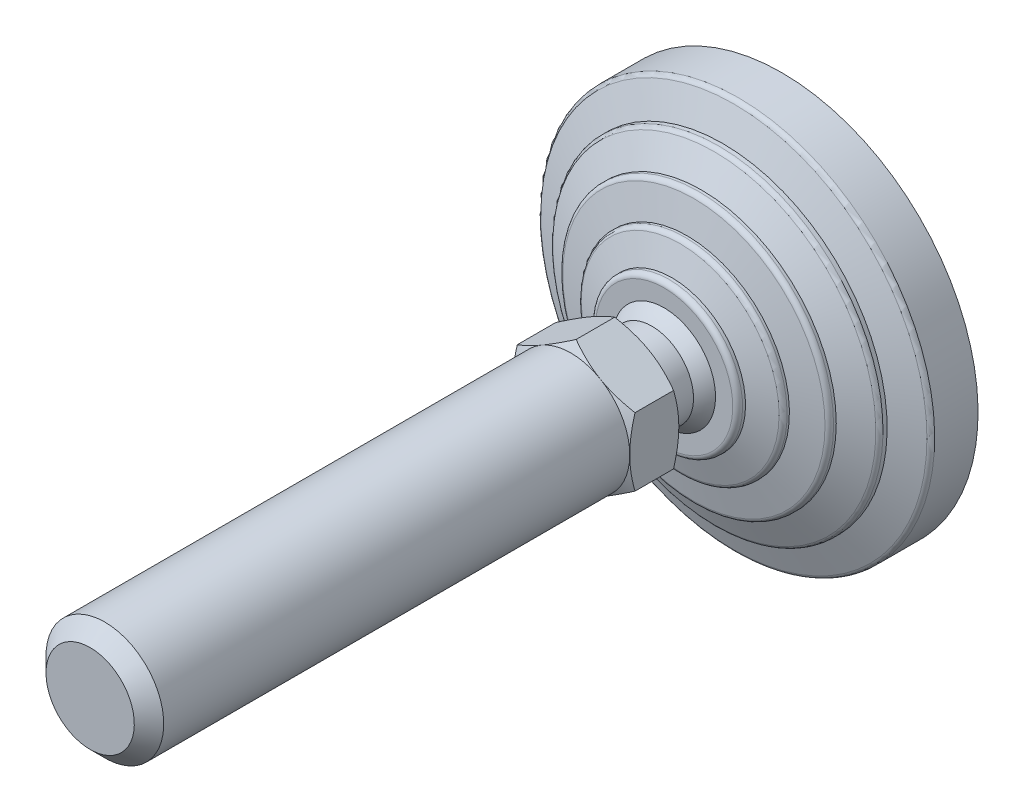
ISO-10303-21;
HEADER;
FILE_DESCRIPTION(('STEP AP214'),'2;1');
FILE_NAME('part.step','',(''),(''),'','','');
FILE_SCHEMA(('AUTOMOTIVE_DESIGN { 1 0 10303 214 1 1 1 1 }'));
ENDSEC;
DATA;
#1=APPLICATION_CONTEXT('core data for automotive mechanical design processes');
#2=APPLICATION_PROTOCOL_DEFINITION('international standard','automotive_design',2000,#1);
#3=PRODUCT_CONTEXT('',#1,'mechanical');
#4=PRODUCT('Part','Part','',(#3));
#5=PRODUCT_RELATED_PRODUCT_CATEGORY('part','',(#4));
#6=PRODUCT_DEFINITION_FORMATION('','',#4);
#7=PRODUCT_DEFINITION_CONTEXT('part definition',#1,'design');
#8=PRODUCT_DEFINITION('design','',#6,#7);
#9=PRODUCT_DEFINITION_SHAPE('','',#8);
#10=(LENGTH_UNIT() NAMED_UNIT(*) SI_UNIT(.MILLI.,.METRE.));
#11=(NAMED_UNIT(*) PLANE_ANGLE_UNIT() SI_UNIT($,.RADIAN.));
#12=(NAMED_UNIT(*) SI_UNIT($,.STERADIAN.) SOLID_ANGLE_UNIT());
#13=UNCERTAINTY_MEASURE_WITH_UNIT(LENGTH_MEASURE(1.E-05),#10,'distance_accuracy_value','');
#14=(GEOMETRIC_REPRESENTATION_CONTEXT(3) GLOBAL_UNCERTAINTY_ASSIGNED_CONTEXT((#13)) GLOBAL_UNIT_ASSIGNED_CONTEXT((#10,
#11,#12)) REPRESENTATION_CONTEXT('',''));
#15=CARTESIAN_POINT('',(0.,0.,0.));
#16=DIRECTION('',(0.,0.,1.));
#17=DIRECTION('',(1.,0.,0.));
#18=AXIS2_PLACEMENT_3D('',#15,#16,#17);
#19=CARTESIAN_POINT('',(-8.4999999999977,0.,35.9999999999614));
#20=DIRECTION('',(0.,0.,1.));
#21=DIRECTION('',(0.,-1.,0.));
#22=AXIS2_PLACEMENT_3D('',#19,#20,#21);
#23=PLANE('',#22);
#24=CARTESIAN_POINT('',(0.,0.,35.9999999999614));
#25=DIRECTION('',(0.,0.,-1.));
#26=DIRECTION('',(0.,1.,0.));
#27=AXIS2_PLACEMENT_3D('',#24,#25,#26);
#28=CIRCLE('',#27,8.4999999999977);
#29=CARTESIAN_POINT('',(0.,8.4999999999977,35.9999999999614));
#30=VERTEX_POINT('',#29);
#31=EDGE_CURVE('E345',#30,#30,#28,.T.);
#32=ORIENTED_EDGE('',*,*,#31,.F.);
#33=EDGE_LOOP('',(#32));
#34=FACE_BOUND('',#33,.T.);
#35=CARTESIAN_POINT('',(0.,0.,35.9999999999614));
#36=DIRECTION('',(0.,0.,-1.));
#37=DIRECTION('',(-1.,0.,0.));
#38=AXIS2_PLACEMENT_3D('',#35,#36,#37);
#39=CIRCLE('',#38,11.9999999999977);
#40=CARTESIAN_POINT('',(6.,10.3923048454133,35.9999999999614));
#41=VERTEX_POINT('',#40);
#42=CARTESIAN_POINT('',(12.,0.,35.9999999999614));
#43=VERTEX_POINT('',#42);
#44=EDGE_CURVE('E507',#41,#43,#39,.T.);
#45=ORIENTED_EDGE('',*,*,#44,.T.);
#46=CARTESIAN_POINT('',(6.,-10.3923048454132,35.9999999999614));
#47=VERTEX_POINT('',#46);
#48=EDGE_CURVE('E140',#43,#47,#39,.T.);
#49=ORIENTED_EDGE('',*,*,#48,.T.);
#50=CARTESIAN_POINT('',(-6.,-10.3923048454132,35.9999999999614));
#51=VERTEX_POINT('',#50);
#52=EDGE_CURVE('E139',#47,#51,#39,.T.);
#53=ORIENTED_EDGE('',*,*,#52,.T.);
#54=CARTESIAN_POINT('',(-12.,0.,35.9999999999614));
#55=VERTEX_POINT('',#54);
#56=EDGE_CURVE('E117',#51,#55,#39,.T.);
#57=ORIENTED_EDGE('',*,*,#56,.T.);
#58=CARTESIAN_POINT('',(-6.,10.3923048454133,35.9999999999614));
#59=VERTEX_POINT('',#58);
#60=EDGE_CURVE('E105',#55,#59,#39,.T.);
#61=ORIENTED_EDGE('',*,*,#60,.T.);
#62=EDGE_CURVE('E34',#59,#41,#39,.T.);
#63=ORIENTED_EDGE('',*,*,#62,.T.);
#64=EDGE_LOOP('',(#45,#49,#53,#57,#61,#63));
#65=FACE_BOUND('',#64,.T.);
#66=ADVANCED_FACE('F14',(#34,#65),#23,.F.);
#67=CARTESIAN_POINT('',(0.,0.,0.));
#68=DIRECTION('',(0.,0.,-1.));
#69=DIRECTION('',(0.,1.,0.));
#70=AXIS2_PLACEMENT_3D('',#67,#68,#69);
#71=CYLINDRICAL_SURFACE('',#70,8.4999999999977);
#72=CARTESIAN_POINT('',(0.,0.,29.4999999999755));
#73=DIRECTION('',(0.,0.,-1.));
#74=DIRECTION('',(0.,1.,0.));
#75=AXIS2_PLACEMENT_3D('',#72,#73,#74);
#76=CIRCLE('',#75,8.4999999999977);
#77=CARTESIAN_POINT('',(0.,8.4999999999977,29.4999999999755));
#78=VERTEX_POINT('',#77);
#79=EDGE_CURVE('E348',#78,#78,#76,.T.);
#80=ORIENTED_EDGE('',*,*,#79,.F.);
#81=EDGE_LOOP('',(#80));
#82=FACE_BOUND('',#81,.T.);
#83=ORIENTED_EDGE('',*,*,#31,.T.);
#84=EDGE_LOOP('',(#83));
#85=FACE_BOUND('',#84,.T.);
#86=ADVANCED_FACE('F313',(#82,#85),#71,.T.);
#87=CARTESIAN_POINT('',(-8.4999999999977,0.,29.4999999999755));
#88=DIRECTION('',(0.,0.,1.));
#89=DIRECTION('',(0.,-1.,0.));
#90=AXIS2_PLACEMENT_3D('',#87,#88,#89);
#91=PLANE('',#90);
#92=CARTESIAN_POINT('',(0.,0.,29.4999999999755));
#93=DIRECTION('',(0.,0.,-1.));
#94=DIRECTION('',(0.,1.,0.));
#95=AXIS2_PLACEMENT_3D('',#92,#93,#94);
#96=CIRCLE('',#95,8.49107182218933);
#97=CARTESIAN_POINT('',(-8.49107182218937,0.,29.4999999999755));
#98=VERTEX_POINT('',#97);
#99=EDGE_CURVE('E351',#98,#98,#96,.T.);
#100=ORIENTED_EDGE('',*,*,#99,.F.);
#101=EDGE_LOOP('',(#100));
#102=FACE_BOUND('',#101,.T.);
#103=ORIENTED_EDGE('',*,*,#79,.T.);
#104=EDGE_LOOP('',(#103));
#105=FACE_BOUND('',#104,.T.);
#106=ADVANCED_FACE('F309',(#102,#105),#91,.F.);
#107=CARTESIAN_POINT('',(-2.80331313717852E-12,0.,20.6702661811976));
#108=DIRECTION('',(0.,0.,-1.));
#109=DIRECTION('',(-1.,0.,0.));
#110=AXIS2_PLACEMENT_3D('',#107,#108,#109);
#111=SPHERICAL_SURFACE('',#110,12.25);
#112=CARTESIAN_POINT('',(0.,0.,27.));
#113=DIRECTION('',(0.,0.,-1.));
#114=DIRECTION('',(0.,1.,0.));
#115=AXIS2_PLACEMENT_3D('',#112,#113,#114);
#116=CIRCLE('',#115,10.4879440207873);
#117=CARTESIAN_POINT('',(-10.4879440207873,0.,27.));
#118=VERTEX_POINT('',#117);
#119=EDGE_CURVE('E354',#118,#118,#116,.T.);
#120=CARTESIAN_POINT('',(-10.4879440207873,0.,27.));
#121=CARTESIAN_POINT('',(-10.4706730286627,0.,27.0286168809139));
#122=CARTESIAN_POINT('',(-10.4532849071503,0.,27.0571630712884));
#123=CARTESIAN_POINT('',(-10.4182755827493,0.,27.1141121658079));
#124=CARTESIAN_POINT('',(-10.4006543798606,0.,27.1425150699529));
#125=CARTESIAN_POINT('',(-10.3651800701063,0.,27.1991756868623));
#126=CARTESIAN_POINT('',(-10.3473269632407,0.,27.2274333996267));
#127=CARTESIAN_POINT('',(-10.3113900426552,0.,27.283801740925));
#128=CARTESIAN_POINT('',(-10.2933062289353,0.,27.3119123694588));
#129=CARTESIAN_POINT('',(-10.2569091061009,0.,27.367984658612));
#130=CARTESIAN_POINT('',(-10.2385957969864,0.,27.3959463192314));
#131=CARTESIAN_POINT('',(-10.2017409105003,0.,27.4517187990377));
#132=CARTESIAN_POINT('',(-10.1831993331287,0.,27.4795296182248));
#133=CARTESIAN_POINT('',(-10.1458891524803,0.,27.5349985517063));
#134=CARTESIAN_POINT('',(-10.1271205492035,0.,27.5626566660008));
#135=CARTESIAN_POINT('',(-10.0893575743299,0.,27.6178183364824));
#136=CARTESIAN_POINT('',(-10.0703632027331,0.,27.6453218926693));
#137=CARTESIAN_POINT('',(-10.0321499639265,0.,27.7001726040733));
#138=CARTESIAN_POINT('',(-10.0129310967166,0.,27.7275197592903));
#139=CARTESIAN_POINT('',(-9.97427015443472,0.,27.7820558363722));
#140=CARTESIAN_POINT('',(-9.9548280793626,0.,27.8092447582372));
#141=CARTESIAN_POINT('',(-9.91572202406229,0.,27.8634625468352));
#142=CARTESIAN_POINT('',(-9.8960580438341,0.,27.8904914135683));
#143=CARTESIAN_POINT('',(-9.85650949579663,0.,27.9443872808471));
#144=CARTESIAN_POINT('',(-9.83662492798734,0.,27.9712542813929));
#145=CARTESIAN_POINT('',(-9.79663653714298,0.,28.0248246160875));
#146=CARTESIAN_POINT('',(-9.77653271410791,0.,28.0515279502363));
#147=CARTESIAN_POINT('',(-9.7361071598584,0.,28.1047691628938));
#148=CARTESIAN_POINT('',(-9.71578542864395,0.,28.1313070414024));
#149=CARTESIAN_POINT('',(-9.6749254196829,0.,28.1842155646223));
#150=CARTESIAN_POINT('',(-9.6543871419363,0.,28.2105862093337));
#151=CARTESIAN_POINT('',(-9.61309541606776,0.,28.2631584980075));
#152=CARTESIAN_POINT('',(-9.59234196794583,0.,28.2893601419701));
#153=CARTESIAN_POINT('',(-9.55062129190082,0.,28.3415926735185));
#154=CARTESIAN_POINT('',(-9.52965406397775,0.,28.3676235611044));
#155=CARTESIAN_POINT('',(-9.48750723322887,0.,28.4195128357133));
#156=CARTESIAN_POINT('',(-9.46632763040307,0.,28.4453712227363));
#157=CARTESIAN_POINT('',(-9.42375746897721,0.,28.4969137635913));
#158=CARTESIAN_POINT('',(-9.40236691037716,0.,28.5225979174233));
#159=CARTESIAN_POINT('',(-9.35937627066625,0.,28.5737902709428));
#160=CARTESIAN_POINT('',(-9.3377761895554,0.,28.5992984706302));
#161=CARTESIAN_POINT('',(-9.29436795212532,0.,28.6501372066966));
#162=CARTESIAN_POINT('',(-9.27255979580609,0.,28.6754677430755));
#163=CARTESIAN_POINT('',(-9.22873686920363,0.,28.7259494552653));
#164=CARTESIAN_POINT('',(-9.20672209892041,0.,28.7511006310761));
#165=CARTESIAN_POINT('',(-9.16248741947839,0.,28.8012219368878));
#166=CARTESIAN_POINT('',(-9.1402675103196,0.,28.8261920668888));
#167=CARTESIAN_POINT('',(-9.09562404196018,0.,28.87594960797));
#168=CARTESIAN_POINT('',(-9.07320048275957,0.,28.9007370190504));
#169=CARTESIAN_POINT('',(-9.02815121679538,0.,28.9501274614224));
#170=CARTESIAN_POINT('',(-9.00552551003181,0.,28.974730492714));
#171=CARTESIAN_POINT('',(-8.96007346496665,0.,29.023750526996));
#172=CARTESIAN_POINT('',(-8.93724712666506,0.,29.0481675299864));
#173=CARTESIAN_POINT('',(-8.89139534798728,0.,29.0968138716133));
#174=CARTESIAN_POINT('',(-8.86836990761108,0.,29.1210432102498));
#175=CARTESIAN_POINT('',(-8.82212146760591,0.,29.1693125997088));
#176=CARTESIAN_POINT('',(-8.79889846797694,0.,29.1933526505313));
#177=CARTESIAN_POINT('',(-8.75225646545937,0.,29.2412418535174));
#178=CARTESIAN_POINT('',(-8.72883746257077,0.,29.2650910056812));
#179=CARTESIAN_POINT('',(-8.68180502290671,0.,29.3125968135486));
#180=CARTESIAN_POINT('',(-8.65819158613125,0.,29.3362534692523));
#181=CARTESIAN_POINT('',(-8.6107718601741,0.,29.3833726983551));
#182=CARTESIAN_POINT('',(-8.58696557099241,0.,29.4068352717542));
#183=CARTESIAN_POINT('',(-8.53916173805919,0.,29.4535647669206));
#184=CARTESIAN_POINT('',(-8.51516419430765,0.,29.4768316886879));
#185=CARTESIAN_POINT('',(-8.49107182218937,0.,29.4999999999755));
#186=B_SPLINE_CURVE_WITH_KNOTS('',3,(#120,#121,#122,#123,#124,#125,#126,#127,#128,#129,#130,
#131,#132,#133,#134,#135,#136,#137,#138,#139,#140,#141,#142,#143,#144,#145,#146,#147,#148,#149,
#150,#151,#152,#153,#154,#155,#156,#157,#158,#159,#160,#161,#162,#163,#164,#165,#166,#167,#168,
#169,#170,#171,#172,#173,#174,#175,#176,#177,#178,#179,#180,#181,#182,#183,#184,#185),
.UNSPECIFIED.,.F.,.F.,(4,2,2,2,2,2,2,2,2,2,2,2,2,2,2,2,2,2,2,2,2,2,2,2,2,2,2,2,2,2,2,2,4),(0.,
0.100273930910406,0.200547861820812,0.300821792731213,0.401095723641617,0.501369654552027,
0.60164358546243,0.701917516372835,0.802191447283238,0.902465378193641,1.00273930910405,
1.10301324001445,1.20328717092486,1.30356110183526,1.40383503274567,1.50410896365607,
1.60438289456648,1.70465682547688,1.80493075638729,1.90520468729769,2.00547861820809,
2.1057525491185,2.20602648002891,2.30630041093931,2.40657434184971,2.50684827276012,
2.60712220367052,2.70739613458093,2.80767006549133,2.90794399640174,3.00821792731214,
3.10849185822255,3.20876578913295),.UNSPECIFIED.);
#187=EDGE_CURVE('BSEAM305',#118,#98,#186,.T.);
#188=ORIENTED_EDGE('',*,*,#119,.F.);
#189=ORIENTED_EDGE('',*,*,#99,.T.);
#190=ORIENTED_EDGE('',*,*,#187,.T.);
#191=ORIENTED_EDGE('',*,*,#187,.F.);
#192=EDGE_LOOP('',(#188,#190,#189,#191));
#193=FACE_BOUND('',#192,.T.);
#194=ADVANCED_FACE('F305',(#193),#111,.T.);
#195=CARTESIAN_POINT('',(-10.4879440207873,0.,27.));
#196=DIRECTION('',(0.,0.,-1.));
#197=DIRECTION('',(0.,1.,0.));
#198=AXIS2_PLACEMENT_3D('',#195,#196,#197);
#199=PLANE('',#198);
#200=CARTESIAN_POINT('',(0.,0.,27.));
#201=DIRECTION('',(0.,0.,-1.));
#202=DIRECTION('',(0.,1.,0.));
#203=AXIS2_PLACEMENT_3D('',#200,#201,#202);
#204=CIRCLE('',#203,13.9999999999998);
#205=CARTESIAN_POINT('',(0.,13.9999999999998,27.));
#206=VERTEX_POINT('',#205);
#207=EDGE_CURVE('E357',#206,#206,#204,.T.);
#208=ORIENTED_EDGE('',*,*,#207,.F.);
#209=EDGE_LOOP('',(#208));
#210=FACE_BOUND('',#209,.T.);
#211=ORIENTED_EDGE('',*,*,#119,.T.);
#212=EDGE_LOOP('',(#211));
#213=FACE_BOUND('',#212,.T.);
#214=ADVANCED_FACE('F301',(#210,#213),#199,.F.);
#215=CARTESIAN_POINT('',(0.,0.,26.));
#216=DIRECTION('',(0.,0.,-1.));
#217=DIRECTION('',(0.,1.,0.));
#218=AXIS2_PLACEMENT_3D('',#215,#216,#217);
#219=TOROIDAL_SURFACE('',#218,13.9999999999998,1.);
#220=CARTESIAN_POINT('',(0.,0.,26.));
#221=DIRECTION('',(0.,0.,-1.));
#222=DIRECTION('',(0.,1.,0.));
#223=AXIS2_PLACEMENT_3D('',#220,#221,#222);
#224=CIRCLE('',#223,14.9999999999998);
#225=CARTESIAN_POINT('',(0.,14.9999999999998,26.));
#226=VERTEX_POINT('',#225);
#227=EDGE_CURVE('E360',#226,#226,#224,.T.);
#228=ORIENTED_EDGE('',*,*,#227,.F.);
#229=EDGE_LOOP('',(#228));
#230=FACE_BOUND('',#229,.T.);
#231=ORIENTED_EDGE('',*,*,#207,.T.);
#232=EDGE_LOOP('',(#231));
#233=FACE_BOUND('',#232,.T.);
#234=ADVANCED_FACE('F297',(#230,#233),#219,.T.);
#235=CARTESIAN_POINT('',(0.,0.,0.));
#236=DIRECTION('',(0.,0.,-1.));
#237=DIRECTION('',(0.,1.,0.));
#238=AXIS2_PLACEMENT_3D('',#235,#236,#237);
#239=CYLINDRICAL_SURFACE('',#238,14.9999999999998);
#240=CARTESIAN_POINT('',(0.,0.,25.4025287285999));
#241=DIRECTION('',(0.,0.,-1.));
#242=DIRECTION('',(0.,1.,0.));
#243=AXIS2_PLACEMENT_3D('',#240,#241,#242);
#244=CIRCLE('',#243,14.9999999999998);
#245=CARTESIAN_POINT('',(0.,14.9999999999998,25.4025287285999));
#246=VERTEX_POINT('',#245);
#247=EDGE_CURVE('E363',#246,#246,#244,.T.);
#248=ORIENTED_EDGE('',*,*,#247,.F.);
#249=EDGE_LOOP('',(#248));
#250=FACE_BOUND('',#249,.T.);
#251=ORIENTED_EDGE('',*,*,#227,.T.);
#252=EDGE_LOOP('',(#251));
#253=FACE_BOUND('',#252,.T.);
#254=ADVANCED_FACE('F293',(#250,#253),#239,.T.);
#255=CARTESIAN_POINT('',(0.,0.,25.4025287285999));
#256=DIRECTION('',(0.,0.,-1.));
#257=DIRECTION('',(0.,1.,0.));
#258=AXIS2_PLACEMENT_3D('',#255,#256,#257);
#259=CONICAL_SURFACE('',#258,14.9999999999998,1.25589726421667);
#260=CARTESIAN_POINT('',(0.,0.,23.7216684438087));
#261=DIRECTION('',(0.,0.,-1.));
#262=DIRECTION('',(0.,1.,0.));
#263=AXIS2_PLACEMENT_3D('',#260,#261,#262);
#264=CIRCLE('',#263,20.1601635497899);
#265=CARTESIAN_POINT('',(0.,20.1601635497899,23.7216684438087));
#266=VERTEX_POINT('',#265);
#267=EDGE_CURVE('E366',#266,#266,#264,.T.);
#268=ORIENTED_EDGE('',*,*,#267,.F.);
#269=EDGE_LOOP('',(#268));
#270=FACE_BOUND('',#269,.T.);
#271=ORIENTED_EDGE('',*,*,#247,.T.);
#272=EDGE_LOOP('',(#271));
#273=FACE_BOUND('',#272,.T.);
#274=ADVANCED_FACE('F289',(#270,#273),#259,.T.);
#275=CARTESIAN_POINT('',(0.,0.,22.7708407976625));
#276=DIRECTION('',(0.,0.,-1.));
#277=DIRECTION('',(0.,1.,0.));
#278=AXIS2_PLACEMENT_3D('',#275,#276,#277);
#279=TOROIDAL_SURFACE('',#278,19.8504430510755,1.);
#280=CARTESIAN_POINT('',(0.,0.,22.7708407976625));
#281=DIRECTION('',(0.,0.,-1.));
#282=DIRECTION('',(0.,1.,0.));
#283=AXIS2_PLACEMENT_3D('',#280,#281,#282);
#284=CIRCLE('',#283,20.8504430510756);
#285=CARTESIAN_POINT('',(0.,20.8504430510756,22.7708407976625));
#286=VERTEX_POINT('',#285);
#287=EDGE_CURVE('E369',#286,#286,#284,.T.);
#288=ORIENTED_EDGE('',*,*,#287,.F.);
#289=EDGE_LOOP('',(#288));
#290=FACE_BOUND('',#289,.T.);
#291=ORIENTED_EDGE('',*,*,#267,.T.);
#292=EDGE_LOOP('',(#291));
#293=FACE_BOUND('',#292,.T.);
#294=ADVANCED_FACE('F285',(#290,#293),#279,.T.);
#295=CARTESIAN_POINT('',(0.,0.,0.));
#296=DIRECTION('',(0.,0.,-1.));
#297=DIRECTION('',(0.,1.,0.));
#298=AXIS2_PLACEMENT_3D('',#295,#296,#297);
#299=CYLINDRICAL_SURFACE('',#298,20.8504430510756);
#300=CARTESIAN_POINT('',(0.,0.,22.2987385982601));
#301=DIRECTION('',(0.,0.,-1.));
#302=DIRECTION('',(0.,1.,0.));
#303=AXIS2_PLACEMENT_3D('',#300,#301,#302);
#304=CIRCLE('',#303,20.8504430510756);
#305=CARTESIAN_POINT('',(0.,20.8504430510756,22.2987385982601));
#306=VERTEX_POINT('',#305);
#307=EDGE_CURVE('E372',#306,#306,#304,.T.);
#308=ORIENTED_EDGE('',*,*,#307,.F.);
#309=EDGE_LOOP('',(#308));
#310=FACE_BOUND('',#309,.T.);
#311=ORIENTED_EDGE('',*,*,#287,.T.);
#312=EDGE_LOOP('',(#311));
#313=FACE_BOUND('',#312,.T.);
#314=ADVANCED_FACE('F281',(#310,#313),#299,.T.);
#315=CARTESIAN_POINT('',(0.,0.,22.2987385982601));
#316=DIRECTION('',(0.,0.,-1.));
#317=DIRECTION('',(0.,1.,0.));
#318=AXIS2_PLACEMENT_3D('',#315,#316,#317);
#319=CONICAL_SURFACE('',#318,20.8504430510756,1.34067144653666);
#320=CARTESIAN_POINT('',(0.,0.,20.9217501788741));
#321=DIRECTION('',(0.,0.,-1.));
#322=DIRECTION('',(0.,1.,0.));
#323=AXIS2_PLACEMENT_3D('',#320,#321,#322);
#324=CIRCLE('',#323,26.7280991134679);
#325=CARTESIAN_POINT('',(0.,26.7280991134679,20.9217501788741));
#326=VERTEX_POINT('',#325);
#327=EDGE_CURVE('E375',#326,#326,#324,.T.);
#328=ORIENTED_EDGE('',*,*,#327,.F.);
#329=EDGE_LOOP('',(#328));
#330=FACE_BOUND('',#329,.T.);
#331=ORIENTED_EDGE('',*,*,#307,.T.);
#332=EDGE_LOOP('',(#331));
#333=FACE_BOUND('',#332,.T.);
#334=ADVANCED_FACE('F277',(#330,#333),#319,.T.);
#335=CARTESIAN_POINT('',(0.,0.,19.9481122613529));
#336=DIRECTION('',(0.,0.,-1.));
#337=DIRECTION('',(0.,1.,0.));
#338=AXIS2_PLACEMENT_3D('',#335,#336,#337);
#339=TOROIDAL_SURFACE('',#338,26.5,1.);
#340=CARTESIAN_POINT('',(0.,0.,19.9481122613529));
#341=DIRECTION('',(0.,0.,-1.));
#342=DIRECTION('',(0.,1.,0.));
#343=AXIS2_PLACEMENT_3D('',#340,#341,#342);
#344=CIRCLE('',#343,27.5);
#345=CARTESIAN_POINT('',(0.,27.5,19.9481122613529));
#346=VERTEX_POINT('',#345);
#347=EDGE_CURVE('E378',#346,#346,#344,.T.);
#348=ORIENTED_EDGE('',*,*,#347,.F.);
#349=EDGE_LOOP('',(#348));
#350=FACE_BOUND('',#349,.T.);
#351=ORIENTED_EDGE('',*,*,#327,.T.);
#352=EDGE_LOOP('',(#351));
#353=FACE_BOUND('',#352,.T.);
#354=ADVANCED_FACE('F273',(#350,#353),#339,.T.);
#355=CARTESIAN_POINT('',(0.,0.,0.));
#356=DIRECTION('',(0.,0.,-1.));
#357=DIRECTION('',(0.,1.,0.));
#358=AXIS2_PLACEMENT_3D('',#355,#356,#357);
#359=CYLINDRICAL_SURFACE('',#358,27.5);
#360=CARTESIAN_POINT('',(0.,0.,19.4025287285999));
#361=DIRECTION('',(0.,0.,-1.));
#362=DIRECTION('',(0.,1.,0.));
#363=AXIS2_PLACEMENT_3D('',#360,#361,#362);
#364=CIRCLE('',#363,27.5);
#365=CARTESIAN_POINT('',(0.,27.5,19.4025287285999));
#366=VERTEX_POINT('',#365);
#367=EDGE_CURVE('E381',#366,#366,#364,.T.);
#368=ORIENTED_EDGE('',*,*,#367,.F.);
#369=EDGE_LOOP('',(#368));
#370=FACE_BOUND('',#369,.T.);
#371=ORIENTED_EDGE('',*,*,#347,.T.);
#372=EDGE_LOOP('',(#371));
#373=FACE_BOUND('',#372,.T.);
#374=ADVANCED_FACE('F269',(#370,#373),#359,.T.);
#375=CARTESIAN_POINT('',(0.,0.,19.4025287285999));
#376=DIRECTION('',(0.,0.,-1.));
#377=DIRECTION('',(0.,1.,0.));
#378=AXIS2_PLACEMENT_3D('',#375,#376,#377);
#379=CONICAL_SURFACE('',#378,27.5,1.12022914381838);
#380=CARTESIAN_POINT('',(0.,0.,16.773091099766));
#381=DIRECTION('',(0.,0.,-1.));
#382=DIRECTION('',(0.,1.,0.));
#383=AXIS2_PLACEMENT_3D('',#380,#381,#382);
#384=CIRCLE('',#383,32.935476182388);
#385=CARTESIAN_POINT('',(0.,32.935476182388,16.773091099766));
#386=VERTEX_POINT('',#385);
#387=EDGE_CURVE('E384',#386,#386,#384,.T.);
#388=ORIENTED_EDGE('',*,*,#387,.F.);
#389=EDGE_LOOP('',(#388));
#390=FACE_BOUND('',#389,.T.);
#391=ORIENTED_EDGE('',*,*,#367,.T.);
#392=EDGE_LOOP('',(#391));
#393=FACE_BOUND('',#392,.T.);
#394=ADVANCED_FACE('F265',(#390,#393),#379,.T.);
#395=CARTESIAN_POINT('',(0.,0.,15.8728908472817));
#396=DIRECTION('',(0.,0.,-1.));
#397=DIRECTION('',(0.,1.,0.));
#398=AXIS2_PLACEMENT_3D('',#395,#396,#397);
#399=TOROIDAL_SURFACE('',#398,32.5,1.);
#400=CARTESIAN_POINT('',(0.,0.,15.8728908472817));
#401=DIRECTION('',(0.,0.,-1.));
#402=DIRECTION('',(0.,1.,0.));
#403=AXIS2_PLACEMENT_3D('',#400,#401,#402);
#404=CIRCLE('',#403,33.5);
#405=CARTESIAN_POINT('',(0.,33.5,15.8728908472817));
#406=VERTEX_POINT('',#405);
#407=EDGE_CURVE('E387',#406,#406,#404,.T.);
#408=ORIENTED_EDGE('',*,*,#407,.F.);
#409=EDGE_LOOP('',(#408));
#410=FACE_BOUND('',#409,.T.);
#411=ORIENTED_EDGE('',*,*,#387,.T.);
#412=EDGE_LOOP('',(#411));
#413=FACE_BOUND('',#412,.T.);
#414=ADVANCED_FACE('F261',(#410,#413),#399,.T.);
#415=CARTESIAN_POINT('',(0.,0.,0.));
#416=DIRECTION('',(0.,0.,-1.));
#417=DIRECTION('',(0.,1.,0.));
#418=AXIS2_PLACEMENT_3D('',#415,#416,#417);
#419=CYLINDRICAL_SURFACE('',#418,33.5);
#420=CARTESIAN_POINT('',(0.,0.,15.0315037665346));
#421=DIRECTION('',(0.,0.,-1.));
#422=DIRECTION('',(0.,1.,0.));
#423=AXIS2_PLACEMENT_3D('',#420,#421,#422);
#424=CIRCLE('',#423,33.5);
#425=CARTESIAN_POINT('',(0.,33.5,15.0315037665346));
#426=VERTEX_POINT('',#425);
#427=EDGE_CURVE('E390',#426,#426,#424,.T.);
#428=ORIENTED_EDGE('',*,*,#427,.F.);
#429=EDGE_LOOP('',(#428));
#430=FACE_BOUND('',#429,.T.);
#431=ORIENTED_EDGE('',*,*,#407,.T.);
#432=EDGE_LOOP('',(#431));
#433=FACE_BOUND('',#432,.T.);
#434=ADVANCED_FACE('F257',(#430,#433),#419,.T.);
#435=CARTESIAN_POINT('',(0.,0.,15.0315037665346));
#436=DIRECTION('',(0.,0.,-1.));
#437=DIRECTION('',(0.,1.,0.));
#438=AXIS2_PLACEMENT_3D('',#435,#436,#437);
#439=CONICAL_SURFACE('',#438,33.5,1.20362249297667);
#440=CARTESIAN_POINT('',(0.,0.,12.7780502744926));
#441=DIRECTION('',(0.,0.,-1.));
#442=DIRECTION('',(0.,1.,0.));
#443=AXIS2_PLACEMENT_3D('',#440,#441,#442);
#444=CIRCLE('',#443,39.3589790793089);
#445=CARTESIAN_POINT('',(0.,39.3589790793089,12.7780502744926));
#446=VERTEX_POINT('',#445);
#447=EDGE_CURVE('E393',#446,#446,#444,.T.);
#448=ORIENTED_EDGE('',*,*,#447,.F.);
#449=EDGE_LOOP('',(#448));
#450=FACE_BOUND('',#449,.T.);
#451=ORIENTED_EDGE('',*,*,#427,.T.);
#452=EDGE_LOOP('',(#451));
#453=FACE_BOUND('',#452,.T.);
#454=ADVANCED_FACE('F253',(#450,#453),#439,.T.);
#455=CARTESIAN_POINT('',(0.,0.,11.8447046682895));
#456=DIRECTION('',(0.,0.,-1.));
#457=DIRECTION('',(0.,1.,0.));
#458=AXIS2_PLACEMENT_3D('',#455,#456,#457);
#459=TOROIDAL_SURFACE('',#458,39.,1.);
#460=CARTESIAN_POINT('',(0.,0.,11.8447046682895));
#461=DIRECTION('',(0.,0.,-1.));
#462=DIRECTION('',(0.,1.,0.));
#463=AXIS2_PLACEMENT_3D('',#460,#461,#462);
#464=CIRCLE('',#463,40.);
#465=CARTESIAN_POINT('',(0.,40.,11.8447046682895));
#466=VERTEX_POINT('',#465);
#467=EDGE_CURVE('E396',#466,#466,#464,.T.);
#468=ORIENTED_EDGE('',*,*,#467,.F.);
#469=EDGE_LOOP('',(#468));
#470=FACE_BOUND('',#469,.T.);
#471=ORIENTED_EDGE('',*,*,#447,.T.);
#472=EDGE_LOOP('',(#471));
#473=FACE_BOUND('',#472,.T.);
#474=ADVANCED_FACE('F249',(#470,#473),#459,.T.);
#475=CARTESIAN_POINT('',(0.,0.,0.));
#476=DIRECTION('',(0.,0.,-1.));
#477=DIRECTION('',(0.,1.,0.));
#478=AXIS2_PLACEMENT_3D('',#475,#476,#477);
#479=CYLINDRICAL_SURFACE('',#478,40.);
#480=CARTESIAN_POINT('',(0.,0.,3.));
#481=DIRECTION('',(0.,0.,-1.));
#482=DIRECTION('',(0.,1.,0.));
#483=AXIS2_PLACEMENT_3D('',#480,#481,#482);
#484=CIRCLE('',#483,40.);
#485=CARTESIAN_POINT('',(0.,40.,3.));
#486=VERTEX_POINT('',#485);
#487=EDGE_CURVE('E399',#486,#486,#484,.T.);
#488=ORIENTED_EDGE('',*,*,#487,.F.);
#489=EDGE_LOOP('',(#488));
#490=FACE_BOUND('',#489,.T.);
#491=ORIENTED_EDGE('',*,*,#467,.T.);
#492=EDGE_LOOP('',(#491));
#493=FACE_BOUND('',#492,.T.);
#494=ADVANCED_FACE('F245',(#490,#493),#479,.T.);
#495=CARTESIAN_POINT('',(-33.5,0.,3.));
#496=DIRECTION('',(0.,0.,1.));
#497=DIRECTION('',(0.,-1.,0.));
#498=AXIS2_PLACEMENT_3D('',#495,#496,#497);
#499=PLANE('',#498);
#500=CARTESIAN_POINT('',(0.,0.,3.));
#501=DIRECTION('',(0.,0.,-1.));
#502=DIRECTION('',(0.,1.,0.));
#503=AXIS2_PLACEMENT_3D('',#500,#501,#502);
#504=CIRCLE('',#503,33.5);
#505=CARTESIAN_POINT('',(0.,33.5,3.));
#506=VERTEX_POINT('',#505);
#507=EDGE_CURVE('E402',#506,#506,#504,.T.);
#508=ORIENTED_EDGE('',*,*,#507,.F.);
#509=EDGE_LOOP('',(#508));
#510=FACE_BOUND('',#509,.T.);
#511=ORIENTED_EDGE('',*,*,#487,.T.);
#512=EDGE_LOOP('',(#511));
#513=FACE_BOUND('',#512,.T.);
#514=ADVANCED_FACE('F241',(#510,#513),#499,.F.);
#515=CARTESIAN_POINT('',(0.,0.,0.));
#516=DIRECTION('',(0.,0.,-1.));
#517=DIRECTION('',(0.,1.,0.));
#518=AXIS2_PLACEMENT_3D('',#515,#516,#517);
#519=CYLINDRICAL_SURFACE('',#518,33.5);
#520=CARTESIAN_POINT('',(0.,0.,0.));
#521=DIRECTION('',(0.,0.,-1.));
#522=DIRECTION('',(0.,1.,0.));
#523=AXIS2_PLACEMENT_3D('',#520,#521,#522);
#524=CIRCLE('',#523,33.5);
#525=CARTESIAN_POINT('',(0.,33.5,0.));
#526=VERTEX_POINT('',#525);
#527=EDGE_CURVE('E405',#526,#526,#524,.T.);
#528=ORIENTED_EDGE('',*,*,#527,.F.);
#529=EDGE_LOOP('',(#528));
#530=FACE_BOUND('',#529,.T.);
#531=ORIENTED_EDGE('',*,*,#507,.T.);
#532=EDGE_LOOP('',(#531));
#533=FACE_BOUND('',#532,.T.);
#534=ADVANCED_FACE('F237',(#530,#533),#519,.T.);
#535=CARTESIAN_POINT('',(0.,0.,0.));
#536=DIRECTION('',(0.,0.,1.));
#537=DIRECTION('',(0.,-1.,0.));
#538=AXIS2_PLACEMENT_3D('',#535,#536,#537);
#539=PLANE('',#538);
#540=ORIENTED_EDGE('',*,*,#527,.T.);
#541=EDGE_LOOP('',(#540));
#542=FACE_BOUND('',#541,.T.);
#543=ADVANCED_FACE('F233',(#542),#539,.F.);
#544=CARTESIAN_POINT('',(0.,0.,38.2662593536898));
#545=DIRECTION('',(0.,0.,1.));
#546=DIRECTION('',(1.,0.,0.));
#547=AXIS2_PLACEMENT_3D('',#544,#545,#546);
#548=CONICAL_SURFACE('',#547,15.9252763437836,1.0471975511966);
#549=CARTESIAN_POINT('',(12.,-18.5408083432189,41.8227650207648));
#550=CARTESIAN_POINT('',(12.,-18.2790506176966,41.6958961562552));
#551=CARTESIAN_POINT('',(12.,-18.0169838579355,41.5696652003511));
#552=CARTESIAN_POINT('',(12.,-17.4921677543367,41.318623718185));
#553=CARTESIAN_POINT('',(12.,-17.2294184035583,41.1938132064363));
#554=CARTESIAN_POINT('',(12.,-16.4399787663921,40.8216959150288));
#555=CARTESIAN_POINT('',(12.,-15.912175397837,40.5767415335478));
#556=CARTESIAN_POINT('',(12.,-14.8501076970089,40.0932665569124));
#557=CARTESIAN_POINT('',(12.,-14.3158237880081,39.8547888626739));
#558=CARTESIAN_POINT('',(12.,-13.2429827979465,39.3876815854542));
#559=CARTESIAN_POINT('',(12.,-12.7044259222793,39.1590515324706));
#560=CARTESIAN_POINT('',(12.,-11.6050505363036,38.7072065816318));
#561=CARTESIAN_POINT('',(12.,-11.044066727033,38.4843917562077));
#562=CARTESIAN_POINT('',(12.,-9.91550638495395,38.0557929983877));
#563=CARTESIAN_POINT('',(12.,-9.34792911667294,37.8500109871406));
#564=CARTESIAN_POINT('',(12.,-8.20638258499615,37.4609339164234));
#565=CARTESIAN_POINT('',(12.,-7.63242917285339,37.277592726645));
#566=CARTESIAN_POINT('',(12.,-6.47623501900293,36.9393162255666));
#567=CARTESIAN_POINT('',(12.,-5.89399697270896,36.7843718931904));
#568=CARTESIAN_POINT('',(12.,-5.01594131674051,36.5793173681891));
#569=CARTESIAN_POINT('',(12.,-4.72326745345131,36.5156611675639));
#570=CARTESIAN_POINT('',(12.,-4.13593300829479,36.3982340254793));
#571=CARTESIAN_POINT('',(12.,-3.84127246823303,36.3444628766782));
#572=CARTESIAN_POINT('',(12.,-3.25017240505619,36.2477590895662));
#573=CARTESIAN_POINT('',(12.,-2.95373290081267,36.2048263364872));
#574=CARTESIAN_POINT('',(12.,-2.35939528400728,36.1306584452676));
#575=CARTESIAN_POINT('',(12.,-2.061497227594,36.0994228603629));
#576=CARTESIAN_POINT('',(12.,-1.46851724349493,36.0496575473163));
#577=CARTESIAN_POINT('',(12.,-1.17344875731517,36.0309686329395));
#578=CARTESIAN_POINT('',(12.,-0.58278673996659,36.0060809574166));
#579=CARTESIAN_POINT('',(12.,-0.2871932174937,35.9998819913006));
#580=CARTESIAN_POINT('',(12.,0.303992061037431,36.000121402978));
#581=CARTESIAN_POINT('',(12.,0.599583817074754,36.0065598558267));
#582=CARTESIAN_POINT('',(12.,1.19023503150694,36.0319182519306));
#583=CARTESIAN_POINT('',(12.,1.48529446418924,36.0508387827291));
#584=CARTESIAN_POINT('',(12.,2.19653817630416,36.1110927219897));
#585=CARTESIAN_POINT('',(12.,2.6122195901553,36.1584663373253));
#586=CARTESIAN_POINT('',(12.,3.44045389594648,36.2753902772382));
#587=CARTESIAN_POINT('',(12.,3.85300634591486,36.344943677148));
#588=CARTESIAN_POINT('',(12.,4.67460488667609,36.5037527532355));
#589=CARTESIAN_POINT('',(12.,5.08364793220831,36.5930240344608));
#590=CARTESIAN_POINT('',(12.,5.89760951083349,36.7885485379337));
#591=CARTESIAN_POINT('',(12.,6.30252811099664,36.8948014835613));
#592=CARTESIAN_POINT('',(12.,7.11707275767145,37.1241988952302));
#593=CARTESIAN_POINT('',(12.,7.52660859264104,37.2476614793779));
#594=CARTESIAN_POINT('',(12.,8.34164528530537,37.5071880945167));
#595=CARTESIAN_POINT('',(12.,8.7471461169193,37.643252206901));
#596=CARTESIAN_POINT('',(12.,9.55431561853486,37.9258351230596));
#597=CARTESIAN_POINT('',(12.,9.95598555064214,38.0723503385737));
#598=CARTESIAN_POINT('',(12.,10.7560077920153,38.3741270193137));
#599=CARTESIAN_POINT('',(12.,11.1543601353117,38.5293883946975));
#600=CARTESIAN_POINT('',(12.,12.0741205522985,38.8976522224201));
#601=CARTESIAN_POINT('',(12.,12.5944519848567,39.1133391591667));
#602=CARTESIAN_POINT('',(12.,13.6308467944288,39.5547624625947));
#603=CARTESIAN_POINT('',(12.,14.1469099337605,39.7804993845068));
#604=CARTESIAN_POINT('',(12.,15.1755356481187,40.2400669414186));
#605=CARTESIAN_POINT('',(12.,15.6880974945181,40.4738992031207));
#606=CARTESIAN_POINT('',(12.,16.7101829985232,40.9480718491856));
#607=CARTESIAN_POINT('',(12.,17.2197067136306,41.1884121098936));
#608=CARTESIAN_POINT('',(12.,18.2367221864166,41.6746632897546));
#609=CARTESIAN_POINT('',(12.,18.7442113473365,41.9205796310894));
#610=CARTESIAN_POINT('',(12.,19.7570317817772,42.4168154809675));
#611=CARTESIAN_POINT('',(12.,20.262363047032,42.6671350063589));
#612=CARTESIAN_POINT('',(12.,21.2711318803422,43.1714111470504));
#613=CARTESIAN_POINT('',(12.,21.7745696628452,43.4253673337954));
#614=CARTESIAN_POINT('',(12.,22.7798780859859,43.9363644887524));
#615=CARTESIAN_POINT('',(12.,23.2817487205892,44.1934054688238));
#616=CARTESIAN_POINT('',(12.,24.7045745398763,44.9267966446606));
#617=CARTESIAN_POINT('',(12.,25.6239328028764,45.40624501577));
#618=CARTESIAN_POINT('',(12.,27.4592014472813,46.3717512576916));
#619=CARTESIAN_POINT('',(12.,28.3751117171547,46.8578093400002));
#620=CARTESIAN_POINT('',(12.,30.202071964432,47.8338641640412));
#621=CARTESIAN_POINT('',(12.,31.1131283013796,48.3238490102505));
#622=CARTESIAN_POINT('',(12.,32.4780757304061,49.0617946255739));
#623=CARTESIAN_POINT('',(12.,32.9327738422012,49.3082649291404));
#624=CARTESIAN_POINT('',(12.,33.8416848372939,49.8020969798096));
#625=CARTESIAN_POINT('',(12.,34.2958977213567,50.0494587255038));
#626=CARTESIAN_POINT('',(12.,34.7498950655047,50.2972155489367));
#627=B_SPLINE_CURVE_WITH_KNOTS('',3,(#549,#550,#551,#552,#553,#554,#555,#556,#557,#558,#559,
#560,#561,#562,#563,#564,#565,#566,#567,#568,#569,#570,#571,#572,#573,#574,#575,#576,#577,#578,
#579,#580,#581,#582,#583,#584,#585,#586,#587,#588,#589,#590,#591,#592,#593,#594,#595,#596,#597,
#598,#599,#600,#601,#602,#603,#604,#605,#606,#607,#608,#609,#610,#611,#612,#613,#614,#615,#616,
#617,#618,#619,#620,#621,#622,#623,#624,#625,#626),.UNSPECIFIED.,.F.,.F.,(4,2,2,2,2,2,2,2,2,2,2,
2,2,2,2,2,2,2,2,2,2,2,2,2,2,2,2,2,2,2,2,2,2,2,2,2,2,2,4),(0.,0.872646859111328,1.7453026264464,
3.49087599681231,5.2460701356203,7.00118041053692,8.81180981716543,10.6226431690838,
12.4296892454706,14.2361602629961,15.1345696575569,16.0329602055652,16.9313412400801,
17.829687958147,18.7164098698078,19.6031172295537,20.4898298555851,21.3765842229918,
22.6310051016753,23.8855999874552,25.1411913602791,26.3967622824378,27.6797434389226,
28.9627328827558,30.245283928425,31.5278218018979,33.2174709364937,34.9072135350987,
36.5972976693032,38.2873497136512,39.9791223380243,41.6709014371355,43.3624827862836,
45.0540706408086,48.1646270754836,51.2752832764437,54.3786517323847,55.9302572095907,
57.4818602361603),.UNSPECIFIED.);
#628=CARTESIAN_POINT('',(12.,6.92820323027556,37.0717967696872));
#629=VERTEX_POINT('',#628);
#630=EDGE_CURVE('E115',#629,#43,#627,.F.);
#631=ORIENTED_EDGE('',*,*,#630,.T.);
#632=ORIENTED_EDGE('',*,*,#44,.F.);
#633=CARTESIAN_POINT('',(-1.61921596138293,14.7912612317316,37.6625528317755));
#634=CARTESIAN_POINT('',(-1.32409330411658,14.6208720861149,37.546248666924));
#635=CARTESIAN_POINT('',(-1.02778844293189,14.4498003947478,37.4338197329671));
#636=CARTESIAN_POINT('',(-0.432575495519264,14.1061540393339,37.2181070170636));
#637=CARTESIAN_POINT('',(-0.13366647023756,13.9335788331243,37.1148266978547));
#638=CARTESIAN_POINT('',(0.468022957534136,13.5861932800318,36.9184873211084));
#639=CARTESIAN_POINT('',(0.770814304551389,13.4113766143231,36.8254726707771));
#640=CARTESIAN_POINT('',(1.37903072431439,13.0602227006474,36.6518245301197));
#641=CARTESIAN_POINT('',(1.68445551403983,12.8838856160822,36.5711897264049));
#642=CARTESIAN_POINT('',(2.28834732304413,12.5352285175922,36.4262968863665));
#643=CARTESIAN_POINT('',(2.58673639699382,12.3629535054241,36.3616085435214));
#644=CARTESIAN_POINT('',(3.18565728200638,12.0171663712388,36.2470091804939));
#645=CARTESIAN_POINT('',(3.4861891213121,11.8436542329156,36.1970983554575));
#646=CARTESIAN_POINT('',(4.0883693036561,11.4959853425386,36.1135074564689));
#647=CARTESIAN_POINT('',(4.39001438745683,11.3218304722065,36.0797963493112));
#648=CARTESIAN_POINT('',(4.99437564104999,10.9729023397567,36.0294919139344));
#649=CARTESIAN_POINT('',(5.29709177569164,10.7981290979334,36.0128980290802));
#650=CARTESIAN_POINT('',(5.88462179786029,10.4589184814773,35.9978311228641));
#651=CARTESIAN_POINT('',(6.16941602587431,10.2944924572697,35.9983270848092));
#652=CARTESIAN_POINT('',(6.73866186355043,9.96583821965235,36.0148912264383));
#653=CARTESIAN_POINT('',(7.02311347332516,9.80161000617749,36.0309594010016));
#654=CARTESIAN_POINT('',(7.59152756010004,9.47343598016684,36.0782482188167));
#655=CARTESIAN_POINT('',(7.87548850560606,9.3094910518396,36.1094932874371));
#656=CARTESIAN_POINT('',(8.44192590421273,8.98245826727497,36.1862899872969));
#657=CARTESIAN_POINT('',(8.72440237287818,8.81937040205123,36.2318414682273));
#658=CARTESIAN_POINT('',(9.58573968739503,8.32207707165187,36.3914112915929));
#659=CARTESIAN_POINT('',(10.1616937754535,7.98954982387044,36.5268522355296));
#660=CARTESIAN_POINT('',(11.0175144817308,7.49544150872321,36.7632928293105));
#661=CARTESIAN_POINT('',(11.3010465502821,7.33174419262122,36.847512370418));
#662=CARTESIAN_POINT('',(11.8656646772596,7.00576176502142,37.0256773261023));
#663=CARTESIAN_POINT('',(12.146751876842,6.84347599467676,37.1196179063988));
#664=CARTESIAN_POINT('',(12.4267466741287,6.68182092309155,37.2177725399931));
#665=B_SPLINE_CURVE_WITH_KNOTS('',3,(#633,#634,#635,#636,#637,#638,#639,#640,#641,#642,#643,
#644,#645,#646,#647,#648,#649,#650,#651,#652,#653,#654,#655,#656,#657,#658,#659,#660,#661,#662,
#663,#664),.UNSPECIFIED.,.F.,.F.,(4,2,2,2,2,2,2,2,2,2,2,2,2,2,2,4),(0.,1.08027208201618,
2.16095131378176,3.24613586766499,4.33120521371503,5.38262627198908,6.43406121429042,
7.48347385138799,8.53285236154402,9.51904021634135,10.50522774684,11.4930077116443,
12.4807772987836,14.5145484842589,15.5286097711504,16.5421691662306),.UNSPECIFIED.);
#666=EDGE_CURVE('E18',#41,#629,#665,.T.);
#667=ORIENTED_EDGE('',*,*,#666,.T.);
#668=EDGE_LOOP('',(#631,#632,#667));
#669=FACE_BOUND('',#668,.T.);
#670=ADVANCED_FACE('F157',(#669),#548,.T.);
#671=CARTESIAN_POINT('',(-21.7140918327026,1.31976969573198,41.6315682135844));
#672=CARTESIAN_POINT('',(-21.4847371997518,1.45218765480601,41.5040351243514));
#673=CARTESIAN_POINT('',(-21.2550971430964,1.5847704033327,41.3771867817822));
#674=CARTESIAN_POINT('',(-20.7951851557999,1.85030071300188,41.1250188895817));
#675=CARTESIAN_POINT('',(-20.5649132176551,1.98324827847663,40.9996993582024));
#676=CARTESIAN_POINT('',(-19.8729845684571,2.38273347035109,40.6262333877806));
#677=CARTESIAN_POINT('',(-19.4102962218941,2.64986671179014,40.3806248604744));
#678=CARTESIAN_POINT('',(-18.4787309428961,3.18770617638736,39.8963193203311));
#679=CARTESIAN_POINT('',(-18.0098334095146,3.45842429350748,39.6576750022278));
#680=CARTESIAN_POINT('',(-17.0680570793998,4.00215911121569,39.1911409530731));
#681=CARTESIAN_POINT('',(-16.5951785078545,4.27517568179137,38.9632506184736));
#682=CARTESIAN_POINT('',(-15.6402370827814,4.82651137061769,38.5191011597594));
#683=CARTESIAN_POINT('',(-15.1581297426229,5.10485617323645,38.3029688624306));
#684=CARTESIAN_POINT('',(-14.1880695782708,5.66492067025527,37.8885932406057));
#685=CARTESIAN_POINT('',(-13.7001160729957,5.9466407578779,37.6903520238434));
#686=CARTESIAN_POINT('',(-12.7187286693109,6.51324503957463,37.3174453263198));
#687=CARTESIAN_POINT('',(-12.2253105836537,6.79812010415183,37.1427248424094));
#688=CARTESIAN_POINT('',(-11.231357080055,7.37197942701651,36.8228679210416));
#689=CARTESIAN_POINT('',(-10.7308241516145,7.66096224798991,36.6777213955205));
#690=CARTESIAN_POINT('',(-9.97744380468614,8.09592659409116,36.4884960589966));
#691=CARTESIAN_POINT('',(-9.7272159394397,8.24039571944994,36.4304032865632));
#692=CARTESIAN_POINT('',(-9.22516400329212,8.53025553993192,36.3242300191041));
#693=CARTESIAN_POINT('',(-8.97333997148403,8.67564621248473,36.2761492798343));
#694=CARTESIAN_POINT('',(-8.46828276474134,8.96724112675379,36.190871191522));
#695=CARTESIAN_POINT('',(-8.21504946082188,9.11344544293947,36.1536748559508));
#696=CARTESIAN_POINT('',(-7.70750394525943,9.40647698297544,36.0909261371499));
#697=CARTESIAN_POINT('',(-7.45319176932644,9.55330418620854,36.0653733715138));
#698=CARTESIAN_POINT('',(-6.94529160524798,9.8465404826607,36.0265808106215));
#699=CARTESIAN_POINT('',(-6.69170755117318,9.99294730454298,36.0132727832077));
#700=CARTESIAN_POINT('',(-6.18428095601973,10.2859101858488,35.9990282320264));
#701=CARTESIAN_POINT('',(-5.93043841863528,10.4324662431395,35.9980915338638));
#702=CARTESIAN_POINT('',(-5.42300963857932,10.7254303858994,36.0086109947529));
#703=CARTESIAN_POINT('',(-5.16942334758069,10.8718384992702,36.0200640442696));
#704=CARTESIAN_POINT('',(-4.66287572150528,11.1642939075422,36.0550912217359));
#705=CARTESIAN_POINT('',(-4.40991442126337,11.3103411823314,36.0786660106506));
#706=CARTESIAN_POINT('',(-3.78623019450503,11.6704254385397,36.1512601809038));
#707=CARTESIAN_POINT('',(-3.41608783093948,11.8841272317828,36.2070321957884));
#708=CARTESIAN_POINT('',(-2.67890745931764,12.3097385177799,36.341330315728));
#709=CARTESIAN_POINT('',(-2.31186996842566,12.5216477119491,36.4198601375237));
#710=CARTESIAN_POINT('',(-1.58064067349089,12.943823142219,36.5969962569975));
#711=CARTESIAN_POINT('',(-1.21645687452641,13.1540847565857,36.6956462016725));
#712=CARTESIAN_POINT('',(-0.491920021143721,13.572396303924,36.9099797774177));
#713=CARTESIAN_POINT('',(-0.131566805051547,13.7804463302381,37.0256626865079));
#714=CARTESIAN_POINT('',(0.593369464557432,14.1989884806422,37.2740645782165));
#715=CARTESIAN_POINT('',(0.957869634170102,14.4094327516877,37.4071039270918));
#716=CARTESIAN_POINT('',(1.68330243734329,14.8282615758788,37.6856150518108));
#717=CARTESIAN_POINT('',(2.04423476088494,15.0366459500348,37.8310878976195));
#718=CARTESIAN_POINT('',(2.76078388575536,15.4503457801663,38.1314549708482));
#719=CARTESIAN_POINT('',(3.11641932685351,15.6556719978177,38.2862901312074));
#720=CARTESIAN_POINT('',(3.64767051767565,15.9623900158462,38.5248493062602));
#721=CARTESIAN_POINT('',(3.82436020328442,16.0644018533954,38.6054072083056));
#722=CARTESIAN_POINT('',(4.17706555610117,16.2680363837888,38.7684522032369));
#723=CARTESIAN_POINT('',(4.35308124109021,16.3696590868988,38.8509392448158));
#724=CARTESIAN_POINT('',(4.52878529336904,16.4711018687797,38.9343030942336));
#725=B_SPLINE_CURVE_WITH_KNOTS('',3,(#671,#672,#673,#674,#675,#676,#677,#678,#679,#680,#681,
#682,#683,#684,#685,#686,#687,#688,#689,#690,#691,#692,#693,#694,#695,#696,#697,#698,#699,#700,
#701,#702,#703,#704,#705,#706,#707,#708,#709,#710,#711,#712,#713,#714,#715,#716,#717,#718,#719,
#720,#721,#722,#723,#724),.UNSPECIFIED.,.F.,.F.,(4,2,2,2,2,2,2,2,2,2,2,2,2,2,2,2,2,2,2,2,2,2,2,
2,2,2,4),(0.,0.881828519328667,1.76366755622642,3.52765798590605,5.30265633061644,
7.0775549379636,8.86884214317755,10.6603401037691,12.4475730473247,14.2341953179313,
15.1182109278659,16.0022049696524,16.8862812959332,17.7703285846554,18.6494192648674,
19.5284975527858,20.4073552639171,21.2862609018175,22.5786134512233,23.8711771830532,
25.1665753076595,26.4619185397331,27.7859290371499,29.110053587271,30.4265543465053,
31.0846020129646,31.7426321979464),.UNSPECIFIED.);
#726=CARTESIAN_POINT('',(0.,13.8564064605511,37.0717967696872));
#727=VERTEX_POINT('',#726);
#728=EDGE_CURVE('E149',#59,#727,#725,.T.);
#729=ORIENTED_EDGE('',*,*,#728,.T.);
#730=EDGE_CURVE('E9',#727,#41,#665,.T.);
#731=ORIENTED_EDGE('',*,*,#730,.T.);
#732=ORIENTED_EDGE('',*,*,#62,.F.);
#733=EDGE_LOOP('',(#729,#731,#732));
#734=FACE_BOUND('',#733,.T.);
#735=ADVANCED_FACE('F500',(#734),#548,.T.);
#736=CARTESIAN_POINT('',(-9.72380471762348,-19.4704477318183,41.6369697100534));
#737=CARTESIAN_POINT('',(-9.49448127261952,-19.3380477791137,41.5094299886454));
#738=CARTESIAN_POINT('',(-9.26487281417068,-19.2054832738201,41.3825739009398));
#739=CARTESIAN_POINT('',(-8.80502495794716,-18.9399899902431,41.1303879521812));
#740=CARTESIAN_POINT('',(-8.57478555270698,-18.8070612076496,41.0050581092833));
#741=CARTESIAN_POINT('',(-7.88295635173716,-18.4076334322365,40.6315569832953));
#742=CARTESIAN_POINT('',(-7.4203364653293,-18.1405397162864,40.3859192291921));
#743=CARTESIAN_POINT('',(-6.48892372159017,-17.602788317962,39.9015448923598));
#744=CARTESIAN_POINT('',(-6.02011036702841,-17.3321188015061,39.6628607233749));
#745=CARTESIAN_POINT('',(-5.07850867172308,-16.7884848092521,39.1962256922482));
#746=CARTESIAN_POINT('',(-4.60572055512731,-16.5155204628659,38.9682742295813));
#747=CARTESIAN_POINT('',(-3.65090271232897,-15.9642561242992,38.5239428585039));
#748=CARTESIAN_POINT('',(-3.1688279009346,-15.6859301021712,38.3076914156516));
#749=CARTESIAN_POINT('',(-2.19883952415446,-15.1259070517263,37.893044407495));
#750=CARTESIAN_POINT('',(-1.71092527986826,-14.8442096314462,37.6946509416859));
#751=CARTESIAN_POINT('',(-0.729617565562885,-14.2776513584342,37.3213958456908));
#752=CARTESIAN_POINT('',(-0.236239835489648,-13.9927995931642,37.14647951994));
#753=CARTESIAN_POINT('',(0.757631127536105,-13.4189879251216,36.8261795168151));
#754=CARTESIAN_POINT('',(1.25812187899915,-13.1300294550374,36.6807857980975));
#755=CARTESIAN_POINT('',(2.01153244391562,-12.6950476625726,36.4911270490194));
#756=CARTESIAN_POINT('',(2.26183120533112,-12.5505376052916,36.4328722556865));
#757=CARTESIAN_POINT('',(2.76402853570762,-12.2605938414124,36.3263694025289));
#758=CARTESIAN_POINT('',(3.01592706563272,-12.1151601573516,36.2781210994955));
#759=CARTESIAN_POINT('',(3.52113775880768,-11.8234766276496,36.1925045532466));
#760=CARTESIAN_POINT('',(3.77445005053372,-11.6772267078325,36.1551373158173));
#761=CARTESIAN_POINT('',(4.28215904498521,-11.384100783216,36.0920464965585));
#762=CARTESIAN_POINT('',(4.5365557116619,-11.2372247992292,36.0663225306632));
#763=CARTESIAN_POINT('',(5.0446220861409,-10.9438925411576,36.0271925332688));
#764=CARTESIAN_POINT('',(5.29828780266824,-10.7974385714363,36.0137178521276));
#765=CARTESIAN_POINT('',(5.80588378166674,-10.504377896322,35.9991464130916));
#766=CARTESIAN_POINT('',(6.05981404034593,-10.3577711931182,35.9980494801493));
#767=CARTESIAN_POINT('',(6.56742358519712,-10.0647026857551,36.0082586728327));
#768=CARTESIAN_POINT('',(6.821102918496,-9.91824085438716,36.0195616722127));
#769=CARTESIAN_POINT('',(7.32784131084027,-9.62567530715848,36.0543020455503));
#770=CARTESIAN_POINT('',(7.58090033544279,-9.47957161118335,36.0777400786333));
#771=CARTESIAN_POINT('',(8.20434408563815,-9.11962619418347,36.1499592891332));
#772=CARTESIAN_POINT('',(8.57415309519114,-8.9061168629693,36.2054692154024));
#773=CARTESIAN_POINT('',(9.3106791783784,-8.48088333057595,36.3392238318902));
#774=CARTESIAN_POINT('',(9.67739573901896,-8.26915942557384,36.4174722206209));
#775=CARTESIAN_POINT('',(10.4079921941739,-7.84734936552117,36.5940360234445));
#776=CARTESIAN_POINT('',(10.7718641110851,-7.63726781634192,36.6923950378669));
#777=CARTESIAN_POINT('',(11.495784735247,-7.21931204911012,36.9061453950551));
#778=CARTESIAN_POINT('',(11.8558336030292,-7.01143773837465,37.0215360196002));
#779=CARTESIAN_POINT('',(12.5801818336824,-6.59323509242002,37.2693577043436));
#780=CARTESIAN_POINT('',(12.9443981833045,-6.38295468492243,37.4021101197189));
#781=CARTESIAN_POINT('',(13.6692658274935,-5.96445215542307,37.6800544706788));
#782=CARTESIAN_POINT('',(14.0299168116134,-5.75623021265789,37.8252474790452));
#783=CARTESIAN_POINT('',(14.7459076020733,-5.34285273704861,38.1250649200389));
#784=CARTESIAN_POINT('',(15.1012660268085,-5.13768645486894,38.2796302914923));
#785=CARTESIAN_POINT('',(15.6321016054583,-4.83120839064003,38.5177904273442));
#786=CARTESIAN_POINT('',(15.808652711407,-4.72927656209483,38.5982162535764));
#787=CARTESIAN_POINT('',(16.1610808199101,-4.52580209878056,38.7609989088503));
#788=CARTESIAN_POINT('',(16.336957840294,-4.42425945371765,38.8433556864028));
#789=CARTESIAN_POINT('',(16.5125231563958,-4.32289677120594,38.926590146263));
#790=B_SPLINE_CURVE_WITH_KNOTS('',3,(#736,#737,#738,#739,#740,#741,#742,#743,#744,#745,#746,
#747,#748,#749,#750,#751,#752,#753,#754,#755,#756,#757,#758,#759,#760,#761,#762,#763,#764,#765,
#766,#767,#768,#769,#770,#771,#772,#773,#774,#775,#776,#777,#778,#779,#780,#781,#782,#783,#784,
#785,#786,#787,#788,#789),.UNSPECIFIED.,.F.,.F.,(4,2,2,2,2,2,2,2,2,2,2,2,2,2,2,2,2,2,2,2,2,2,2,
2,2,2,4),(0.,0.881739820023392,1.76349011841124,3.52730190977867,5.30208197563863,
7.07676261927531,8.86807500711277,10.6595977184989,12.4468713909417,14.233536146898,
15.1178886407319,16.0022196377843,16.8866323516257,17.7710158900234,18.6504118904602,
19.5297954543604,20.4089573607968,21.2881670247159,22.5792740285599,23.8705911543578,
25.1647381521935,26.4588305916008,27.7816439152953,29.104571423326,30.4198885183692,
31.0773441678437,31.7347823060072),.UNSPECIFIED.);
#791=CARTESIAN_POINT('',(12.,-6.92820323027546,37.0717967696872));
#792=VERTEX_POINT('',#791);
#793=EDGE_CURVE('E135',#792,#47,#790,.F.);
#794=ORIENTED_EDGE('',*,*,#793,.T.);
#795=ORIENTED_EDGE('',*,*,#48,.F.);
#796=EDGE_CURVE('E150',#43,#792,#627,.F.);
#797=ORIENTED_EDGE('',*,*,#796,.T.);
#798=EDGE_LOOP('',(#794,#795,#797));
#799=FACE_BOUND('',#798,.T.);
#800=ADVANCED_FACE('F494',(#799),#548,.T.);
#801=CARTESIAN_POINT('',(0.437878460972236,-14.1092157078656,37.2216782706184));
#802=CARTESIAN_POINT('',(0.157760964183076,-13.9474897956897,37.1233577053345));
#803=CARTESIAN_POINT('',(-0.123449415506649,-13.7851329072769,37.0292477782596));
#804=CARTESIAN_POINT('',(-0.68831601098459,-13.4590070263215,36.8507380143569));
#805=CARTESIAN_POINT('',(-0.971973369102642,-13.2952373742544,36.7663430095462));
#806=CARTESIAN_POINT('',(-1.82818189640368,-12.8009051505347,36.5293653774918));
#807=CARTESIAN_POINT('',(-2.40440330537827,-12.4682235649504,36.3935554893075));
#808=CARTESIAN_POINT('',(-3.2661483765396,-11.9706948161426,36.2334411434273));
#809=CARTESIAN_POINT('',(-3.5487561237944,-11.8075311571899,36.1877125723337));
#810=CARTESIAN_POINT('',(-4.11546249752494,-11.4803430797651,36.1105660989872));
#811=CARTESIAN_POINT('',(-4.39956113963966,-11.3163186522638,36.0791483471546));
#812=CARTESIAN_POINT('',(-4.96825632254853,-10.9879823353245,36.0315237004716));
#813=CARTESIAN_POINT('',(-5.25285131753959,-10.8236713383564,36.0152923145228));
#814=CARTESIAN_POINT('',(-5.82239048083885,-10.4948477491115,35.9984158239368));
#815=CARTESIAN_POINT('',(-6.10733464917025,-10.3303351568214,35.9977707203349));
#816=CARTESIAN_POINT('',(-6.69480927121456,-9.99115652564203,36.0125394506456));
#817=CARTESIAN_POINT('',(-6.99732083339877,-9.816501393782,36.0289639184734));
#818=CARTESIAN_POINT('',(-7.6012808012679,-9.46780494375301,36.0789131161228));
#819=CARTESIAN_POINT('',(-7.90272917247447,-9.29376364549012,36.112438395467));
#820=CARTESIAN_POINT('',(-8.50452243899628,-8.94631814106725,36.1956469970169));
#821=CARTESIAN_POINT('',(-8.80486409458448,-8.77291580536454,36.2453612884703));
#822=CARTESIAN_POINT('',(-9.40341141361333,-8.42734434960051,36.3595628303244));
#823=CARTESIAN_POINT('',(-9.70161710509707,-8.25517521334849,36.4240498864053));
#824=CARTESIAN_POINT('',(-10.3051354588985,-7.90673372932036,36.5685317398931));
#825=CARTESIAN_POINT('',(-10.6103704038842,-7.7305062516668,36.6489565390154));
#826=CARTESIAN_POINT('',(-11.2182114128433,-7.37956908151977,36.8221869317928));
#827=CARTESIAN_POINT('',(-11.5208171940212,-7.20485955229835,36.914993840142));
#828=CARTESIAN_POINT('',(-12.1221420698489,-6.85768447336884,37.1109239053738));
#829=CARTESIAN_POINT('',(-12.4208720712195,-6.6852126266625,37.2140027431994));
#830=CARTESIAN_POINT('',(-13.0157286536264,-6.34177201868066,37.4293179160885));
#831=CARTESIAN_POINT('',(-13.3118561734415,-6.17080271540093,37.5415507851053));
#832=CARTESIAN_POINT('',(-13.6068017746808,-6.00051579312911,37.6576619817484));
#833=B_SPLINE_CURVE_WITH_KNOTS('',3,(#801,#802,#803,#804,#805,#806,#807,#808,#809,#810,#811,
#812,#813,#814,#815,#816,#817,#818,#819,#820,#821,#822,#823,#824,#825,#826,#827,#828,#829,#830,
#831,#832),.UNSPECIFIED.,.F.,.F.,(4,2,2,2,2,2,2,2,2,2,2,2,2,2,2,4),(0.,1.01411083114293,
2.02872390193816,4.06362524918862,5.0519187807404,6.04022269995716,7.02693001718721,
8.01363739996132,9.06228484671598,10.1109659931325,11.1616651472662,12.2123504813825,
13.2966382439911,14.3810412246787,15.4609529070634,16.5404575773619),.UNSPECIFIED.);
#834=CARTESIAN_POINT('',(0.,-13.856406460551,37.0717967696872));
#835=VERTEX_POINT('',#834);
#836=EDGE_CURVE('E445',#835,#51,#833,.T.);
#837=ORIENTED_EDGE('',*,*,#836,.T.);
#838=ORIENTED_EDGE('',*,*,#52,.F.);
#839=EDGE_CURVE('E128',#47,#835,#790,.F.);
#840=ORIENTED_EDGE('',*,*,#839,.T.);
#841=EDGE_LOOP('',(#837,#838,#840));
#842=FACE_BOUND('',#841,.T.);
#843=ADVANCED_FACE('F488',(#842),#548,.T.);
#844=CARTESIAN_POINT('',(-12.,-6.92820323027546,37.0717967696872));
#845=VERTEX_POINT('',#844);
#846=EDGE_CURVE('E124',#51,#845,#833,.T.);
#847=ORIENTED_EDGE('',*,*,#846,.T.);
#848=CARTESIAN_POINT('',(-12.,-18.5408083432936,41.822765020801));
#849=CARTESIAN_POINT('',(-12.,-18.27905061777,41.6958961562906));
#850=CARTESIAN_POINT('',(-12.,-18.0169838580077,41.5696652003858));
#851=CARTESIAN_POINT('',(-12.,-17.4921677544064,41.3186237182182));
#852=CARTESIAN_POINT('',(-12.,-17.2294184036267,41.1938132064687));
#853=CARTESIAN_POINT('',(-12.,-16.4399787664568,40.8216959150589));
#854=CARTESIAN_POINT('',(-12.,-15.9121753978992,40.5767415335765));
#855=CARTESIAN_POINT('',(-12.,-14.8501076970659,40.093266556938));
#856=CARTESIAN_POINT('',(-12.,-14.3158237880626,39.854788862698));
#857=CARTESIAN_POINT('',(-12.,-13.2429827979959,39.3876815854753));
#858=CARTESIAN_POINT('',(-12.,-12.7044259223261,39.1590515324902));
#859=CARTESIAN_POINT('',(-12.,-11.605050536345,38.7072065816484));
#860=CARTESIAN_POINT('',(-12.,-11.0440667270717,38.4843917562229));
#861=CARTESIAN_POINT('',(-12.,-9.91550638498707,38.0557929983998));
#862=CARTESIAN_POINT('',(-12.,-9.34792911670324,37.8500109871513));
#863=CARTESIAN_POINT('',(-12.,-8.20638258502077,37.4609339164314));
#864=CARTESIAN_POINT('',(-12.,-7.63242917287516,37.2775927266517));
#865=CARTESIAN_POINT('',(-12.,-6.47623501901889,36.939316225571));
#866=CARTESIAN_POINT('',(-12.,-5.89399697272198,36.7843718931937));
#867=CARTESIAN_POINT('',(-12.,-5.01594131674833,36.5793173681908));
#868=CARTESIAN_POINT('',(-12.,-4.7232674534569,36.515661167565));
#869=CARTESIAN_POINT('',(-12.,-4.13593300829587,36.3982340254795));
#870=CARTESIAN_POINT('',(-12.,-3.84127246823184,36.3444628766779));
#871=CARTESIAN_POINT('',(-12.,-3.25017240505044,36.2477590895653));
#872=CARTESIAN_POINT('',(-12.,-2.95373290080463,36.2048263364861));
#873=CARTESIAN_POINT('',(-12.,-2.35939528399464,36.1306584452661));
#874=CARTESIAN_POINT('',(-12.,-2.06149722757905,36.0994228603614));
#875=CARTESIAN_POINT('',(-12.,-1.46851724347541,36.0496575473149));
#876=CARTESIAN_POINT('',(-12.,-1.17344875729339,36.0309686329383));
#877=CARTESIAN_POINT('',(-12.,-0.582786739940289,36.0060809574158));
#878=CARTESIAN_POINT('',(-12.,-0.287193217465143,35.9998819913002));
#879=CARTESIAN_POINT('',(-12.,0.303992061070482,36.0001214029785));
#880=CARTESIAN_POINT('',(-12.,0.599583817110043,36.0065598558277));
#881=CARTESIAN_POINT('',(-12.,1.19023503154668,36.0319182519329));
#882=CARTESIAN_POINT('',(-12.,1.48529446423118,36.0508387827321));
#883=CARTESIAN_POINT('',(-12.,2.19653817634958,36.1110927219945));
#884=CARTESIAN_POINT('',(-12.,2.61221959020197,36.158466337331));
#885=CARTESIAN_POINT('',(-12.,3.44045389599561,36.275390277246));
#886=CARTESIAN_POINT('',(-12.,3.85300634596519,36.3449436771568));
#887=CARTESIAN_POINT('',(-12.,4.67460488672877,36.5037527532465));
#888=CARTESIAN_POINT('',(-12.,5.08364793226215,36.5930240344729));
#889=CARTESIAN_POINT('',(-12.,5.89760951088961,36.788548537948));
#890=CARTESIAN_POINT('',(-12.,6.30252811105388,36.8948014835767));
#891=CARTESIAN_POINT('',(-12.,7.11707275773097,37.1241988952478));
#892=CARTESIAN_POINT('',(-12.,7.52660859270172,37.2476614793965));
#893=CARTESIAN_POINT('',(-12.,8.34164528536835,37.5071880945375));
#894=CARTESIAN_POINT('',(-12.,8.74714611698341,37.6432522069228));
#895=CARTESIAN_POINT('',(-12.,9.55431561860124,37.9258351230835));
#896=CARTESIAN_POINT('',(-12.,9.95598555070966,38.0723503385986));
#897=CARTESIAN_POINT('',(-12.,10.756007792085,38.3741270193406));
#898=CARTESIAN_POINT('',(-12.,11.1543601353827,38.5293883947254));
#899=CARTESIAN_POINT('',(-12.,12.0741205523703,38.8976522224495));
#900=CARTESIAN_POINT('',(-12.,12.5944519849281,39.1133391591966));
#901=CARTESIAN_POINT('',(-12.,13.6308467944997,39.5547624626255));
#902=CARTESIAN_POINT('',(-12.,14.1469099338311,39.7804993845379));
#903=CARTESIAN_POINT('',(-12.,15.1755356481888,40.2400669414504));
#904=CARTESIAN_POINT('',(-12.,15.6880974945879,40.4738992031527));
#905=CARTESIAN_POINT('',(-12.,16.7101829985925,40.9480718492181));
#906=CARTESIAN_POINT('',(-12.,17.2197067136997,41.1884121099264));
#907=CARTESIAN_POINT('',(-12.,18.2367221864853,41.6746632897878));
#908=CARTESIAN_POINT('',(-12.,18.744211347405,41.9205796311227));
#909=CARTESIAN_POINT('',(-12.,19.7570317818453,42.4168154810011));
#910=CARTESIAN_POINT('',(-12.,20.2623630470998,42.6671350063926));
#911=CARTESIAN_POINT('',(-12.,21.2711318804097,43.1714111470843));
#912=CARTESIAN_POINT('',(-12.,21.7745696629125,43.4253673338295));
#913=CARTESIAN_POINT('',(-12.,22.7798780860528,43.9363644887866));
#914=CARTESIAN_POINT('',(-12.,23.281748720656,44.1934054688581));
#915=CARTESIAN_POINT('',(-12.,24.7045745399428,44.9267966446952));
#916=CARTESIAN_POINT('',(-12.,25.6239328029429,45.4062450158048));
#917=CARTESIAN_POINT('',(-12.,27.4592014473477,46.3717512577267));
#918=CARTESIAN_POINT('',(-12.,28.3751117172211,46.8578093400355));
#919=CARTESIAN_POINT('',(-12.,30.2020719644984,47.8338641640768));
#920=CARTESIAN_POINT('',(-12.,31.113128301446,48.3238490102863));
#921=CARTESIAN_POINT('',(-12.,32.4780757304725,49.0617946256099));
#922=CARTESIAN_POINT('',(-12.,32.9327738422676,49.3082649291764));
#923=CARTESIAN_POINT('',(-12.,33.8416848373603,49.8020969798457));
#924=CARTESIAN_POINT('',(-12.,34.2958977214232,50.04945872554));
#925=CARTESIAN_POINT('',(-12.,34.7498950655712,50.297215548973));
#926=B_SPLINE_CURVE_WITH_KNOTS('',3,(#848,#849,#850,#851,#852,#853,#854,#855,#856,#857,#858,
#859,#860,#861,#862,#863,#864,#865,#866,#867,#868,#869,#870,#871,#872,#873,#874,#875,#876,#877,
#878,#879,#880,#881,#882,#883,#884,#885,#886,#887,#888,#889,#890,#891,#892,#893,#894,#895,#896,
#897,#898,#899,#900,#901,#902,#903,#904,#905,#906,#907,#908,#909,#910,#911,#912,#913,#914,#915,
#916,#917,#918,#919,#920,#921,#922,#923,#924,#925),.UNSPECIFIED.,.F.,.F.,(4,2,2,2,2,2,2,2,2,2,2,
2,2,2,2,2,2,2,2,2,2,2,2,2,2,2,2,2,2,2,2,2,2,2,2,2,2,2,4),(0.,0.872646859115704,1.74530262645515,
3.49087599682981,5.24607013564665,7.00118041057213,8.81180981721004,10.6226431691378,
12.429689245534,14.2361602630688,15.1345696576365,16.0329602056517,16.9313412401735,
17.8296879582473,18.7164098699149,19.6031172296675,20.4898298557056,21.3765842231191,
22.6310051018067,23.8855999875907,25.1411913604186,26.3967622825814,27.6797434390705,
28.9627328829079,30.2452839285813,31.5278218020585,33.217470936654,34.9072135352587,
36.5972976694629,38.2873497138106,39.9791223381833,41.6709014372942,43.3624827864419,
45.0540706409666,48.1646270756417,51.2752832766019,54.3786517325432,55.9302572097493,
57.4818602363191),.UNSPECIFIED.);
#927=EDGE_CURVE('E120',#845,#55,#926,.T.);
#928=ORIENTED_EDGE('',*,*,#927,.T.);
#929=ORIENTED_EDGE('',*,*,#56,.F.);
#930=EDGE_LOOP('',(#847,#928,#929));
#931=FACE_BOUND('',#930,.T.);
#932=ADVANCED_FACE('F121',(#931),#548,.T.);
#933=CARTESIAN_POINT('',(-12.,6.92820323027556,37.0717967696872));
#934=VERTEX_POINT('',#933);
#935=EDGE_CURVE('E109',#55,#934,#926,.T.);
#936=ORIENTED_EDGE('',*,*,#935,.T.);
#937=EDGE_CURVE('E111',#934,#59,#725,.T.);
#938=ORIENTED_EDGE('',*,*,#937,.T.);
#939=ORIENTED_EDGE('',*,*,#60,.F.);
#940=EDGE_LOOP('',(#936,#938,#939));
#941=FACE_BOUND('',#940,.T.);
#942=ADVANCED_FACE('F107',(#941),#548,.T.);
#943=CARTESIAN_POINT('',(-8.99999999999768,0.,143.999999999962));
#944=DIRECTION('',(0.,0.,-1.));
#945=DIRECTION('',(0.,1.,0.));
#946=AXIS2_PLACEMENT_3D('',#943,#944,#945);
#947=PLANE('',#946);
#948=CARTESIAN_POINT('',(0.,0.,143.999999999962));
#949=DIRECTION('',(0.,0.,-1.));
#950=DIRECTION('',(0.,1.,0.));
#951=AXIS2_PLACEMENT_3D('',#948,#949,#950);
#952=CIRCLE('',#951,8.99999999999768);
#953=CARTESIAN_POINT('',(0.,8.99999999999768,143.999999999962));
#954=VERTEX_POINT('',#953);
#955=EDGE_CURVE('E340',#954,#954,#952,.T.);
#956=ORIENTED_EDGE('',*,*,#955,.F.);
#957=EDGE_LOOP('',(#956));
#958=FACE_BOUND('',#957,.T.);
#959=ADVANCED_FACE('F16',(#958),#947,.F.);
#960=CARTESIAN_POINT('',(0.,0.,143.999999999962));
#961=DIRECTION('',(0.,0.,-1.));
#962=DIRECTION('',(0.,1.,0.));
#963=AXIS2_PLACEMENT_3D('',#960,#961,#962);
#964=CONICAL_SURFACE('',#963,8.99999999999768,0.785398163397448);
#965=CARTESIAN_POINT('',(0.,0.,140.999999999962));
#966=DIRECTION('',(0.,0.,-1.));
#967=DIRECTION('',(0.,1.,0.));
#968=AXIS2_PLACEMENT_3D('',#965,#966,#967);
#969=CIRCLE('',#968,11.9999999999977);
#970=CARTESIAN_POINT('',(0.,11.9999999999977,140.999999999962));
#971=VERTEX_POINT('',#970);
#972=EDGE_CURVE('E337',#971,#971,#969,.T.);
#973=ORIENTED_EDGE('',*,*,#972,.F.);
#974=EDGE_LOOP('',(#973));
#975=FACE_BOUND('',#974,.T.);
#976=ORIENTED_EDGE('',*,*,#955,.T.);
#977=EDGE_LOOP('',(#976));
#978=FACE_BOUND('',#977,.T.);
#979=ADVANCED_FACE('F324',(#975,#978),#964,.T.);
#980=CARTESIAN_POINT('',(0.,0.,0.));
#981=DIRECTION('',(0.,0.,-1.));
#982=DIRECTION('',(0.,1.,0.));
#983=AXIS2_PLACEMENT_3D('',#980,#981,#982);
#984=CYLINDRICAL_SURFACE('',#983,11.9999999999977);
#985=CARTESIAN_POINT('',(0.,0.,45.9999999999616));
#986=DIRECTION('',(0.,0.,-1.));
#987=DIRECTION('',(0.,1.,0.));
#988=AXIS2_PLACEMENT_3D('',#985,#986,#987);
#989=CIRCLE('',#988,11.9999999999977);
#990=CARTESIAN_POINT('',(6.,10.3923048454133,45.9999999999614));
#991=VERTEX_POINT('',#990);
#992=CARTESIAN_POINT('',(11.9999999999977,0.,45.9999999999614));
#993=VERTEX_POINT('',#992);
#994=EDGE_CURVE('E341',#991,#993,#989,.T.);
#995=ORIENTED_EDGE('',*,*,#994,.F.);
#996=CARTESIAN_POINT('',(0.,0.,45.9999999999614));
#997=DIRECTION('',(0.,0.,-1.));
#998=DIRECTION('',(0.,1.,0.));
#999=AXIS2_PLACEMENT_3D('',#996,#997,#998);
#1000=CIRCLE('',#999,11.9999999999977);
#1001=CARTESIAN_POINT('',(-5.99999999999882,10.3923048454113,45.9999999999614));
#1002=VERTEX_POINT('',#1001);
#1003=EDGE_CURVE('E409',#1002,#991,#1000,.T.);
#1004=ORIENTED_EDGE('',*,*,#1003,.F.);
#1005=CARTESIAN_POINT('',(0.,0.,45.9999999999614));
#1006=DIRECTION('',(0.,0.,-1.));
#1007=DIRECTION('',(-1.,0.,0.));
#1008=AXIS2_PLACEMENT_3D('',#1005,#1006,#1007);
#1009=CIRCLE('',#1008,11.9999999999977);
#1010=CARTESIAN_POINT('',(-11.9999999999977,0.,45.9999999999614));
#1011=VERTEX_POINT('',#1010);
#1012=EDGE_CURVE('E441',#1011,#1002,#1009,.T.);
#1013=ORIENTED_EDGE('',*,*,#1012,.F.);
#1014=CARTESIAN_POINT('',(-5.99999999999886,-10.3923048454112,45.9999999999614));
#1015=VERTEX_POINT('',#1014);
#1016=EDGE_CURVE('E412',#1015,#1011,#1000,.T.);
#1017=ORIENTED_EDGE('',*,*,#1016,.F.);
#1018=CARTESIAN_POINT('',(5.99999999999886,-10.3923048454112,45.9999999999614));
#1019=VERTEX_POINT('',#1018);
#1020=EDGE_CURVE('E438',#1019,#1015,#1000,.T.);
#1021=ORIENTED_EDGE('',*,*,#1020,.F.);
#1022=EDGE_CURVE('E408',#993,#1019,#1000,.T.);
#1023=ORIENTED_EDGE('',*,*,#1022,.F.);
#1024=EDGE_LOOP('',(#995,#1004,#1013,#1017,#1021,#1023));
#1025=FACE_BOUND('',#1024,.T.);
#1026=ORIENTED_EDGE('',*,*,#972,.T.);
#1027=EDGE_LOOP('',(#1026));
#1028=FACE_BOUND('',#1027,.T.);
#1029=ADVANCED_FACE('F321',(#1025,#1028),#984,.T.);
#1030=CARTESIAN_POINT('',(0.,0.,45.9999999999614));
#1031=DIRECTION('',(0.,0.,-1.));
#1032=DIRECTION('',(-1.,0.,0.));
#1033=AXIS2_PLACEMENT_3D('',#1030,#1031,#1032);
#1034=CONICAL_SURFACE('',#1033,11.9999999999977,1.0471975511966);
#1035=CARTESIAN_POINT('',(-21.7140918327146,1.31976969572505,40.3684317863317));
#1036=CARTESIAN_POINT('',(-21.4847371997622,1.45218765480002,40.4959648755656));
#1037=CARTESIAN_POINT('',(-21.2550971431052,1.58477040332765,40.6228132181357));
#1038=CARTESIAN_POINT('',(-20.7951851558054,1.85030071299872,40.8749811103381));
#1039=CARTESIAN_POINT('',(-20.5649132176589,1.98324827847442,41.0003006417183));
#1040=CARTESIAN_POINT('',(-19.872984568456,2.38273347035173,41.3737666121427));
#1041=CARTESIAN_POINT('',(-19.4102962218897,2.64986671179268,41.6193751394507));
#1042=CARTESIAN_POINT('',(-18.4787309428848,3.18770617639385,42.1036806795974));
#1043=CARTESIAN_POINT('',(-18.0098334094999,3.45842429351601,42.3423249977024));
#1044=CARTESIAN_POINT('',(-17.0680570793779,4.00215911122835,42.8088590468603));
#1045=CARTESIAN_POINT('',(-16.595178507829,4.27517568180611,43.0367493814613));
#1046=CARTESIAN_POINT('',(-15.6402370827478,4.82651137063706,43.4808988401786));
#1047=CARTESIAN_POINT('',(-15.1581297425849,5.10485617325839,43.6970311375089));
#1048=CARTESIAN_POINT('',(-14.1880695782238,5.66492067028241,44.1114067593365));
#1049=CARTESIAN_POINT('',(-13.7001160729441,5.94664075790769,44.3096479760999));
#1050=CARTESIAN_POINT('',(-12.7187286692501,6.51324503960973,44.682554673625));
#1051=CARTESIAN_POINT('',(-12.2253105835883,6.79812010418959,44.8572751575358));
#1052=CARTESIAN_POINT('',(-11.2313570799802,7.37197942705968,45.1771320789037));
#1053=CARTESIAN_POINT('',(-10.730824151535,7.66096224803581,45.3222786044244));
#1054=CARTESIAN_POINT('',(-9.97744380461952,8.09592659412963,45.5115039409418));
#1055=CARTESIAN_POINT('',(-9.72721593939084,8.24039571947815,45.5695967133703));
#1056=CARTESIAN_POINT('',(-9.22516400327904,8.53025553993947,45.6757699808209));
#1057=CARTESIAN_POINT('',(-8.97333997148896,8.67564621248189,45.7238507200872));
#1058=CARTESIAN_POINT('',(-8.46828276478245,8.96724112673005,45.8091288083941));
#1059=CARTESIAN_POINT('',(-8.21504946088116,9.11344544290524,45.8463251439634));
#1060=CARTESIAN_POINT('',(-7.70750394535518,9.40647698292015,45.9090738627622));
#1061=CARTESIAN_POINT('',(-7.45319176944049,9.5533041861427,45.9346266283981));
#1062=CARTESIAN_POINT('',(-6.94529160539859,9.84654048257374,45.9734191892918));
#1063=CARTESIAN_POINT('',(-6.69170755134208,9.99294730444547,45.9867272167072));
#1064=CARTESIAN_POINT('',(-6.18428095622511,10.2859101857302,46.0009717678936));
#1065=CARTESIAN_POINT('',(-5.93043841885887,10.4324662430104,46.0019084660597));
#1066=CARTESIAN_POINT('',(-5.42300963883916,10.7254303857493,45.9913890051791));
#1067=CARTESIAN_POINT('',(-5.16942334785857,10.8718384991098,45.9799359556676));
#1068=CARTESIAN_POINT('',(-4.66287572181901,11.1642939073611,45.9449087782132));
#1069=CARTESIAN_POINT('',(-4.4099144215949,11.31034118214,45.9213339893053));
#1070=CARTESIAN_POINT('',(-3.78623019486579,11.6704254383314,45.8487398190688));
#1071=CARTESIAN_POINT('',(-3.41608783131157,11.8841272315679,45.792967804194));
#1072=CARTESIAN_POINT('',(-2.67890745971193,12.3097385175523,45.6586696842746));
#1073=CARTESIAN_POINT('',(-2.31186996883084,12.5216477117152,45.5801398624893));
#1074=CARTESIAN_POINT('',(-1.58064067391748,12.9438231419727,45.4030037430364));
#1075=CARTESIAN_POINT('',(-1.21645687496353,13.1540847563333,45.304353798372));
#1076=CARTESIAN_POINT('',(-0.491920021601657,13.5723963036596,45.0900202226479));
#1077=CARTESIAN_POINT('',(-0.131566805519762,13.7804463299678,44.9743373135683));
#1078=CARTESIAN_POINT('',(0.59336946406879,14.1989884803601,44.7259354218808));
#1079=CARTESIAN_POINT('',(0.957869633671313,14.4094327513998,44.5928960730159));
#1080=CARTESIAN_POINT('',(1.68330243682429,14.8282615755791,44.3143849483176));
#1081=CARTESIAN_POINT('',(2.04423476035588,15.0366459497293,44.1689121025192));
#1082=CARTESIAN_POINT('',(2.7607838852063,15.4503457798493,43.8685450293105));
#1083=CARTESIAN_POINT('',(3.11641932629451,15.655671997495,43.7137098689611));
#1084=CARTESIAN_POINT('',(3.64767051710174,15.9623900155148,43.4751506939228));
#1085=CARTESIAN_POINT('',(3.82436020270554,16.0644018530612,43.3945927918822));
#1086=CARTESIAN_POINT('',(4.17706555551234,16.2680363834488,43.2315477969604));
#1087=CARTESIAN_POINT('',(4.3530812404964,16.369659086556,43.1490607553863));
#1088=CARTESIAN_POINT('',(4.52878529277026,16.471101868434,43.0656969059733));
#1089=B_SPLINE_CURVE_WITH_KNOTS('',3,(#1035,#1036,#1037,#1038,#1039,#1040,#1041,#1042,#1043,
#1044,#1045,#1046,#1047,#1048,#1049,#1050,#1051,#1052,#1053,#1054,#1055,#1056,#1057,#1058,#1059,
#1060,#1061,#1062,#1063,#1064,#1065,#1066,#1067,#1068,#1069,#1070,#1071,#1072,#1073,#1074,#1075,
#1076,#1077,#1078,#1079,#1080,#1081,#1082,#1083,#1084,#1085,#1086,#1087,#1088),.UNSPECIFIED.,
.F.,.F.,(4,2,2,2,2,2,2,2,2,2,2,2,2,2,2,2,2,2,2,2,2,2,2,2,2,2,4),(0.,0.881828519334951,
1.76366755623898,3.5276579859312,5.30265633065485,7.07755493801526,8.86884214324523,
10.6603401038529,12.4475730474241,14.2341953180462,15.1182109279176,16.0022049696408,
16.8862812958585,17.7703285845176,18.6494192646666,19.528497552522,20.4073552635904,
21.2862609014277,22.5786134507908,23.871177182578,25.1665753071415,26.4619185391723,
27.7859290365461,29.1100535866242,30.4265543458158,31.0846020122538,31.7426321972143),.UNSPECIFIED.);
#1090=CARTESIAN_POINT('',(-12.,6.92820323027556,44.9282032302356));
#1091=VERTEX_POINT('',#1090);
#1092=EDGE_CURVE('E220',#1002,#1091,#1089,.F.);
#1093=ORIENTED_EDGE('',*,*,#1092,.T.);
#1094=CARTESIAN_POINT('',(-12.,-18.5408083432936,40.1772349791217));
#1095=CARTESIAN_POINT('',(-12.,-18.27905061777,40.3041038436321));
#1096=CARTESIAN_POINT('',(-12.,-18.0169838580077,40.4303347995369));
#1097=CARTESIAN_POINT('',(-12.,-17.4921677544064,40.6813762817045));
#1098=CARTESIAN_POINT('',(-12.,-17.2294184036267,40.806186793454));
#1099=CARTESIAN_POINT('',(-12.,-16.4399787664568,41.1783040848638));
#1100=CARTESIAN_POINT('',(-12.,-15.9121753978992,41.4232584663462));
#1101=CARTESIAN_POINT('',(-12.,-14.8501076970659,41.9067334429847));
#1102=CARTESIAN_POINT('',(-12.,-14.3158237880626,42.1452111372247));
#1103=CARTESIAN_POINT('',(-12.,-13.2429827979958,42.6123184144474));
#1104=CARTESIAN_POINT('',(-12.,-12.7044259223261,42.8409484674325));
#1105=CARTESIAN_POINT('',(-12.,-11.605050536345,43.2927934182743));
#1106=CARTESIAN_POINT('',(-12.,-11.0440667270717,43.5156082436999));
#1107=CARTESIAN_POINT('',(-12.,-9.91550638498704,43.9442070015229));
#1108=CARTESIAN_POINT('',(-12.,-9.34792911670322,44.1499890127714));
#1109=CARTESIAN_POINT('',(-12.,-8.20638258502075,44.5390660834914));
#1110=CARTESIAN_POINT('',(-12.,-7.63242917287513,44.722407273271));
#1111=CARTESIAN_POINT('',(-12.,-6.47623501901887,45.0606837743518));
#1112=CARTESIAN_POINT('',(-12.,-5.89399697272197,45.2156281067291));
#1113=CARTESIAN_POINT('',(-12.,-5.01594131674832,45.4206826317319));
#1114=CARTESIAN_POINT('',(-12.,-4.72326745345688,45.4843388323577));
#1115=CARTESIAN_POINT('',(-12.,-4.13593300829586,45.6017659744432));
#1116=CARTESIAN_POINT('',(-12.,-3.84127246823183,45.6555371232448));
#1117=CARTESIAN_POINT('',(-12.,-3.25017240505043,45.7522409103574));
#1118=CARTESIAN_POINT('',(-12.,-2.95373290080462,45.7951736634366));
#1119=CARTESIAN_POINT('',(-12.,-2.35939528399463,45.8693415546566));
#1120=CARTESIAN_POINT('',(-12.,-2.06149722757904,45.9005771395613));
#1121=CARTESIAN_POINT('',(-12.,-1.4685172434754,45.9503424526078));
#1122=CARTESIAN_POINT('',(-12.,-1.17344875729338,45.9690313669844));
#1123=CARTESIAN_POINT('',(-12.,-0.582786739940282,45.9939190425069));
#1124=CARTESIAN_POINT('',(-12.,-0.287193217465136,46.0001180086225));
#1125=CARTESIAN_POINT('',(-12.,0.303992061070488,45.9998785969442));
#1126=CARTESIAN_POINT('',(-12.,0.599583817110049,45.993440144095));
#1127=CARTESIAN_POINT('',(-12.,1.19023503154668,45.9680817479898));
#1128=CARTESIAN_POINT('',(-12.,1.48529446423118,45.9491612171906));
#1129=CARTESIAN_POINT('',(-12.,2.19653817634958,45.8889072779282));
#1130=CARTESIAN_POINT('',(-12.,2.61221959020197,45.8415336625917));
#1131=CARTESIAN_POINT('',(-12.,3.44045389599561,45.7246097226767));
#1132=CARTESIAN_POINT('',(-12.,3.85300634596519,45.6550563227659));
#1133=CARTESIAN_POINT('',(-12.,4.67460488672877,45.4962472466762));
#1134=CARTESIAN_POINT('',(-12.,5.08364793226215,45.4069759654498));
#1135=CARTESIAN_POINT('',(-12.,5.89760951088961,45.2114514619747));
#1136=CARTESIAN_POINT('',(-12.,6.30252811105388,45.105198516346));
#1137=CARTESIAN_POINT('',(-12.,7.11707275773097,44.875801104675));
#1138=CARTESIAN_POINT('',(-12.,7.52660859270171,44.7523385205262));
#1139=CARTESIAN_POINT('',(-12.,8.34164528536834,44.4928119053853));
#1140=CARTESIAN_POINT('',(-12.,8.74714611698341,44.3567477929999));
#1141=CARTESIAN_POINT('',(-12.,9.55431561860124,44.0741648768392));
#1142=CARTESIAN_POINT('',(-12.,9.95598555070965,43.9276496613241));
#1143=CARTESIAN_POINT('',(-12.,10.756007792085,43.6258729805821));
#1144=CARTESIAN_POINT('',(-12.,11.1543601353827,43.4706116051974));
#1145=CARTESIAN_POINT('',(-12.,12.0741205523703,43.1023477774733));
#1146=CARTESIAN_POINT('',(-12.,12.5944519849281,42.8866608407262));
#1147=CARTESIAN_POINT('',(-12.,13.6308467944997,42.4452375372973));
#1148=CARTESIAN_POINT('',(-12.,14.1469099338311,42.2195006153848));
#1149=CARTESIAN_POINT('',(-12.,15.1755356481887,41.7599330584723));
#1150=CARTESIAN_POINT('',(-12.,15.6880974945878,41.52610079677));
#1151=CARTESIAN_POINT('',(-12.,16.7101829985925,41.0519281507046));
#1152=CARTESIAN_POINT('',(-12.,17.2197067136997,40.8115878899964));
#1153=CARTESIAN_POINT('',(-12.,18.2367221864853,40.325336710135));
#1154=CARTESIAN_POINT('',(-12.,18.7442113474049,40.0794203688));
#1155=CARTESIAN_POINT('',(-12.,19.7570317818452,39.5831845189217));
#1156=CARTESIAN_POINT('',(-12.,20.2623630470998,39.3328649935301));
#1157=CARTESIAN_POINT('',(-12.,21.2711318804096,38.8285888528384));
#1158=CARTESIAN_POINT('',(-12.,21.7745696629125,38.5746326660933));
#1159=CARTESIAN_POINT('',(-12.,22.7798780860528,38.0636355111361));
#1160=CARTESIAN_POINT('',(-12.,23.281748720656,37.8065945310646));
#1161=CARTESIAN_POINT('',(-12.,24.7045745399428,37.0732033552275));
#1162=CARTESIAN_POINT('',(-12.,25.6239328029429,36.593754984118));
#1163=CARTESIAN_POINT('',(-12.,27.4592014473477,35.628248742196));
#1164=CARTESIAN_POINT('',(-12.,28.3751117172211,35.1421906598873));
#1165=CARTESIAN_POINT('',(-12.,30.2020719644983,34.1661358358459));
#1166=CARTESIAN_POINT('',(-12.,31.113128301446,33.6761509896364));
#1167=CARTESIAN_POINT('',(-12.,32.4780757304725,32.9382053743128));
#1168=CARTESIAN_POINT('',(-12.,32.9327738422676,32.6917350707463));
#1169=CARTESIAN_POINT('',(-12.,33.8416848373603,32.197903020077));
#1170=CARTESIAN_POINT('',(-12.,34.2958977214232,31.9505412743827));
#1171=CARTESIAN_POINT('',(-12.,34.7498950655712,31.7027844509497));
#1172=B_SPLINE_CURVE_WITH_KNOTS('',3,(#1094,#1095,#1096,#1097,#1098,#1099,#1100,#1101,#1102,
#1103,#1104,#1105,#1106,#1107,#1108,#1109,#1110,#1111,#1112,#1113,#1114,#1115,#1116,#1117,#1118,
#1119,#1120,#1121,#1122,#1123,#1124,#1125,#1126,#1127,#1128,#1129,#1130,#1131,#1132,#1133,#1134,
#1135,#1136,#1137,#1138,#1139,#1140,#1141,#1142,#1143,#1144,#1145,#1146,#1147,#1148,#1149,#1150,
#1151,#1152,#1153,#1154,#1155,#1156,#1157,#1158,#1159,#1160,#1161,#1162,#1163,#1164,#1165,#1166,
#1167,#1168,#1169,#1170,#1171),.UNSPECIFIED.,.F.,.F.,(4,2,2,2,2,2,2,2,2,2,2,2,2,2,2,2,2,2,2,2,2,
2,2,2,2,2,2,2,2,2,2,2,2,2,2,2,2,2,4),(0.,0.872646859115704,1.74530262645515,3.49087599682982,
5.24607013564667,7.00118041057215,8.81180981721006,10.6226431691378,12.429689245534,
14.2361602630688,15.1345696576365,16.0329602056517,16.9313412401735,17.8296879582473,
18.7164098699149,19.6031172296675,20.4898298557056,21.3765842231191,22.6310051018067,
23.8855999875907,25.1411913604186,26.3967622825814,27.6797434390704,28.9627328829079,
30.2452839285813,31.5278218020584,33.217470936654,34.9072135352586,36.5972976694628,
38.2873497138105,39.9791223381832,41.6709014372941,43.3624827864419,45.0540706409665,
48.1646270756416,51.2752832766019,54.3786517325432,55.9302572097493,57.4818602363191),.UNSPECIFIED.);
#1173=EDGE_CURVE('E218',#1091,#1011,#1172,.F.);
#1174=ORIENTED_EDGE('',*,*,#1173,.T.);
#1175=ORIENTED_EDGE('',*,*,#1012,.T.);
#1176=EDGE_LOOP('',(#1093,#1174,#1175));
#1177=FACE_BOUND('',#1176,.T.);
#1178=ADVANCED_FACE('F323',(#1177),#1034,.T.);
#1179=CARTESIAN_POINT('',(-12.,-6.92820323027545,44.9282032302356));
#1180=VERTEX_POINT('',#1179);
#1181=EDGE_CURVE('E213',#1011,#1180,#1172,.F.);
#1182=ORIENTED_EDGE('',*,*,#1181,.T.);
#1183=CARTESIAN_POINT('',(-13.6068017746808,-6.00051579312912,44.3423380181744));
#1184=CARTESIAN_POINT('',(-13.3118561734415,-6.17080271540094,44.4584492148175));
#1185=CARTESIAN_POINT('',(-13.0157286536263,-6.34177201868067,44.5706820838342));
#1186=CARTESIAN_POINT('',(-12.4208720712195,-6.68521262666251,44.7859972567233));
#1187=CARTESIAN_POINT('',(-12.1221420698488,-6.85768447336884,44.8890760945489));
#1188=CARTESIAN_POINT('',(-11.5208171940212,-7.20485955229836,45.0850061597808));
#1189=CARTESIAN_POINT('',(-11.2182114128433,-7.37956908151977,45.1778130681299));
#1190=CARTESIAN_POINT('',(-10.6103704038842,-7.73050625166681,45.3510434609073));
#1191=CARTESIAN_POINT('',(-10.3051354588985,-7.90673372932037,45.4314682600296));
#1192=CARTESIAN_POINT('',(-9.70161710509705,-8.2551752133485,45.5759501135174));
#1193=CARTESIAN_POINT('',(-9.40341141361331,-8.42734434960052,45.6404371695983));
#1194=CARTESIAN_POINT('',(-8.80486409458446,-8.77291580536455,45.7546387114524));
#1195=CARTESIAN_POINT('',(-8.50452243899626,-8.94631814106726,45.8043530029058));
#1196=CARTESIAN_POINT('',(-7.90272917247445,-9.29376364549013,45.8875616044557));
#1197=CARTESIAN_POINT('',(-7.60128080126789,-9.46780494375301,45.9210868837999));
#1198=CARTESIAN_POINT('',(-6.99732083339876,-9.81650139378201,45.9710360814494));
#1199=CARTESIAN_POINT('',(-6.69480927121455,-9.99115652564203,45.9874605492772));
#1200=CARTESIAN_POINT('',(-6.10733464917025,-10.3303351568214,46.0022292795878));
#1201=CARTESIAN_POINT('',(-5.82239048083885,-10.4948477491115,46.0015841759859));
#1202=CARTESIAN_POINT('',(-5.25285131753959,-10.8236713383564,45.9847076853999));
#1203=CARTESIAN_POINT('',(-4.96825632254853,-10.9879823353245,45.9684762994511));
#1204=CARTESIAN_POINT('',(-4.39956113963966,-11.3163186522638,45.9208516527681));
#1205=CARTESIAN_POINT('',(-4.11546249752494,-11.4803430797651,45.8894339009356));
#1206=CARTESIAN_POINT('',(-3.5487561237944,-11.8075311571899,45.812287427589));
#1207=CARTESIAN_POINT('',(-3.2661483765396,-11.9706948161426,45.7665588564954));
#1208=CARTESIAN_POINT('',(-2.40440330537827,-12.4682235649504,45.6064445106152));
#1209=CARTESIAN_POINT('',(-1.82818189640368,-12.8009051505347,45.4706346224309));
#1210=CARTESIAN_POINT('',(-0.971973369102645,-13.2952373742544,45.2336569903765));
#1211=CARTESIAN_POINT('',(-0.688316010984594,-13.4590070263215,45.1492619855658));
#1212=CARTESIAN_POINT('',(-0.123449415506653,-13.7851329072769,44.9707522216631));
#1213=CARTESIAN_POINT('',(0.157760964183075,-13.9474897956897,44.8766422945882));
#1214=CARTESIAN_POINT('',(0.43787846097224,-14.1092157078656,44.7783217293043));
#1215=B_SPLINE_CURVE_WITH_KNOTS('',3,(#1183,#1184,#1185,#1186,#1187,#1188,#1189,#1190,#1191,
#1192,#1193,#1194,#1195,#1196,#1197,#1198,#1199,#1200,#1201,#1202,#1203,#1204,#1205,#1206,#1207,
#1208,#1209,#1210,#1211,#1212,#1213,#1214),.UNSPECIFIED.,.F.,.F.,(4,2,2,2,2,2,2,2,2,2,2,2,2,2,2,
4),(0.,1.07950467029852,2.15941635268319,3.24381933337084,4.32810709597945,5.37879243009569,
6.42949158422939,7.47817273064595,8.5268201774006,9.5135275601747,10.5002348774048,
11.4885387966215,12.4768323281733,14.5117336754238,15.526346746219,16.5404575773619),.UNSPECIFIED.);
#1216=EDGE_CURVE('E219',#1180,#1015,#1215,.T.);
#1217=ORIENTED_EDGE('',*,*,#1216,.T.);
#1218=ORIENTED_EDGE('',*,*,#1016,.T.);
#1219=EDGE_LOOP('',(#1182,#1217,#1218));
#1220=FACE_BOUND('',#1219,.T.);
#1221=ADVANCED_FACE('F433',(#1220),#1034,.T.);
#1222=CARTESIAN_POINT('',(0.,-13.856406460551,44.9282032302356));
#1223=VERTEX_POINT('',#1222);
#1224=EDGE_CURVE('E207',#1015,#1223,#1215,.T.);
#1225=ORIENTED_EDGE('',*,*,#1224,.T.);
#1226=CARTESIAN_POINT('',(-9.72380471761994,-19.4704477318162,40.3630302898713));
#1227=CARTESIAN_POINT('',(-9.49448127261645,-19.3380477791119,40.490570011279));
#1228=CARTESIAN_POINT('',(-9.26487281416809,-19.2054832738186,40.6174260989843));
#1229=CARTESIAN_POINT('',(-8.80502495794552,-18.9399899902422,40.8696120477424));
#1230=CARTESIAN_POINT('',(-8.57478555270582,-18.807061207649,40.9949418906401));
#1231=CARTESIAN_POINT('',(-7.88295635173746,-18.4076334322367,41.3684430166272));
#1232=CARTESIAN_POINT('',(-7.42033646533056,-18.1405397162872,41.6140807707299));
#1233=CARTESIAN_POINT('',(-6.48892372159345,-17.6027883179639,42.0984551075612));
#1234=CARTESIAN_POINT('',(-6.02011036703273,-17.3321188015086,42.3371392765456));
#1235=CARTESIAN_POINT('',(-5.07850867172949,-16.7884848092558,42.8037743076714));
#1236=CARTESIAN_POINT('',(-4.60572055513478,-16.5155204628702,43.0317257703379));
#1237=CARTESIAN_POINT('',(-3.6509027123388,-15.9642561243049,43.4760571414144));
#1238=CARTESIAN_POINT('',(-3.16882790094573,-15.6859301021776,43.6923085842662));
#1239=CARTESIAN_POINT('',(-2.19883952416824,-15.1259070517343,44.106955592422));
#1240=CARTESIAN_POINT('',(-1.71092527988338,-14.844209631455,44.3053490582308));
#1241=CARTESIAN_POINT('',(-0.729617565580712,-14.2776513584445,44.6786041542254));
#1242=CARTESIAN_POINT('',(-0.236239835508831,-13.9927995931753,44.8535204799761));
#1243=CARTESIAN_POINT('',(0.757631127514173,-13.4189879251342,45.173820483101));
#1244=CARTESIAN_POINT('',(1.25812187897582,-13.1300294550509,45.3192142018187));
#1245=CARTESIAN_POINT('',(2.01153244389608,-12.6950476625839,45.5088729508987));
#1246=CARTESIAN_POINT('',(2.2618312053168,-12.5505376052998,45.567127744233));
#1247=CARTESIAN_POINT('',(2.76402853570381,-12.2605938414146,45.6736305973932));
#1248=CARTESIAN_POINT('',(3.0159270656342,-12.1151601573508,45.7218789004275));
#1249=CARTESIAN_POINT('',(3.52113775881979,-11.8234766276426,45.807495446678));
#1250=CARTESIAN_POINT('',(3.77445005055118,-11.6772267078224,45.844862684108));
#1251=CARTESIAN_POINT('',(4.28215904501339,-11.3841007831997,45.9079535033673));
#1252=CARTESIAN_POINT('',(4.53655571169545,-11.2372247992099,45.9336774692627));
#1253=CARTESIAN_POINT('',(5.0446220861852,-10.943892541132,45.9728074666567));
#1254=CARTESIAN_POINT('',(5.29828780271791,-10.7974385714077,45.9862821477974));
#1255=CARTESIAN_POINT('',(5.80588378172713,-10.5043778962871,46.0008535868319));
#1256=CARTESIAN_POINT('',(6.05981404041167,-10.3577711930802,46.0019505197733));
#1257=CARTESIAN_POINT('',(6.56742358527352,-10.064702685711,45.9917413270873));
#1258=CARTESIAN_POINT('',(6.8211029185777,-9.91824085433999,45.9804383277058));
#1259=CARTESIAN_POINT('',(7.3278413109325,-9.62567530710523,45.9456979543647));
#1260=CARTESIAN_POINT('',(7.58090033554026,-9.47957161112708,45.9222599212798));
#1261=CARTESIAN_POINT('',(8.20434408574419,-9.11962619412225,45.850040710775));
#1262=CARTESIAN_POINT('',(8.5741530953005,-8.90611686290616,45.7945307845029));
#1263=CARTESIAN_POINT('',(9.31067917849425,-8.48088333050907,45.660776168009));
#1264=CARTESIAN_POINT('',(9.677395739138,-8.26915942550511,45.5825277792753));
#1265=CARTESIAN_POINT('',(10.4079921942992,-7.84734936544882,45.4059639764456));
#1266=CARTESIAN_POINT('',(10.7718641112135,-7.63726781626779,45.3076049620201));
#1267=CARTESIAN_POINT('',(11.4957847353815,-7.21931204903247,45.0938546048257));
#1268=CARTESIAN_POINT('',(11.8558336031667,-7.01143773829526,44.9784639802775));
#1269=CARTESIAN_POINT('',(12.5801818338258,-6.59323509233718,44.7306422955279));
#1270=CARTESIAN_POINT('',(12.9443981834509,-6.38295468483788,44.5978898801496));
#1271=CARTESIAN_POINT('',(13.6692658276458,-5.96445215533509,44.3199455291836));
#1272=CARTESIAN_POINT('',(14.0299168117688,-5.75623021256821,44.1747525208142));
#1273=CARTESIAN_POINT('',(14.7459076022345,-5.34285273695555,43.8749350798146));
#1274=CARTESIAN_POINT('',(15.1012660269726,-5.13768645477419,43.7203697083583));
#1275=CARTESIAN_POINT('',(15.6321016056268,-4.83120839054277,43.4822095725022));
#1276=CARTESIAN_POINT('',(15.8086527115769,-4.72927656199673,43.4017837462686));
#1277=CARTESIAN_POINT('',(16.161080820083,-4.52580209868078,43.2390010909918));
#1278=CARTESIAN_POINT('',(16.3369578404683,-4.42425945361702,43.156644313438));
#1279=CARTESIAN_POINT('',(16.5125231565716,-4.32289677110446,43.0734098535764));
#1280=B_SPLINE_CURVE_WITH_KNOTS('',3,(#1226,#1227,#1228,#1229,#1230,#1231,#1232,#1233,#1234,
#1235,#1236,#1237,#1238,#1239,#1240,#1241,#1242,#1243,#1244,#1245,#1246,#1247,#1248,#1249,#1250,
#1251,#1252,#1253,#1254,#1255,#1256,#1257,#1258,#1259,#1260,#1261,#1262,#1263,#1264,#1265,#1266,
#1267,#1268,#1269,#1270,#1271,#1272,#1273,#1274,#1275,#1276,#1277,#1278,#1279),.UNSPECIFIED.,
.F.,.F.,(4,2,2,2,2,2,2,2,2,2,2,2,2,2,2,2,2,2,2,2,2,2,2,2,2,2,4),(0.,0.881739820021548,
1.76349011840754,3.52730190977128,5.30208197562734,7.07676261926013,8.86807500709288,
10.6595977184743,12.4468713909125,14.2335361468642,15.1178886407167,16.0022196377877,
16.8866323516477,17.7710158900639,18.6504118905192,19.5297954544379,20.4089573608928,
21.2881670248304,22.5792740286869,23.8705911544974,25.1647381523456,26.4588305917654,
27.7816439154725,29.1045714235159,30.4198885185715,31.0773441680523,31.734782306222),.UNSPECIFIED.);
#1281=EDGE_CURVE('E482',#1223,#1019,#1280,.T.);
#1282=ORIENTED_EDGE('',*,*,#1281,.T.);
#1283=ORIENTED_EDGE('',*,*,#1020,.T.);
#1284=EDGE_LOOP('',(#1225,#1282,#1283));
#1285=FACE_BOUND('',#1284,.T.);
#1286=ADVANCED_FACE('F485',(#1285),#1034,.T.);
#1287=CARTESIAN_POINT('',(12.,-6.92820323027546,44.9282032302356));
#1288=VERTEX_POINT('',#1287);
#1289=EDGE_CURVE('E187',#1019,#1288,#1280,.T.);
#1290=ORIENTED_EDGE('',*,*,#1289,.T.);
#1291=CARTESIAN_POINT('',(12.,-18.5408083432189,40.1772349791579));
#1292=CARTESIAN_POINT('',(12.,-18.2790506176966,40.3041038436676));
#1293=CARTESIAN_POINT('',(12.,-18.0169838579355,40.4303347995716));
#1294=CARTESIAN_POINT('',(12.,-17.4921677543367,40.6813762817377));
#1295=CARTESIAN_POINT('',(12.,-17.2294184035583,40.8061867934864));
#1296=CARTESIAN_POINT('',(12.,-16.4399787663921,41.1783040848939));
#1297=CARTESIAN_POINT('',(12.,-15.912175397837,41.4232584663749));
#1298=CARTESIAN_POINT('',(12.,-14.8501076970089,41.9067334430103));
#1299=CARTESIAN_POINT('',(12.,-14.3158237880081,42.1452111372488));
#1300=CARTESIAN_POINT('',(12.,-13.2429827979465,42.6123184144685));
#1301=CARTESIAN_POINT('',(12.,-12.7044259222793,42.8409484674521));
#1302=CARTESIAN_POINT('',(12.,-11.6050505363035,43.292793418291));
#1303=CARTESIAN_POINT('',(12.,-11.044066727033,43.515608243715));
#1304=CARTESIAN_POINT('',(12.,-9.91550638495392,43.9442070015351));
#1305=CARTESIAN_POINT('',(12.,-9.34792911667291,44.1499890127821));
#1306=CARTESIAN_POINT('',(12.,-8.20638258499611,44.5390660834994));
#1307=CARTESIAN_POINT('',(12.,-7.63242917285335,44.7224072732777));
#1308=CARTESIAN_POINT('',(12.,-6.47623501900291,45.0606837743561));
#1309=CARTESIAN_POINT('',(12.,-5.89399697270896,45.2156281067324));
#1310=CARTESIAN_POINT('',(12.,-5.01594131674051,45.4206826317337));
#1311=CARTESIAN_POINT('',(12.,-4.72326745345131,45.4843388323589));
#1312=CARTESIAN_POINT('',(12.,-4.13593300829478,45.6017659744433));
#1313=CARTESIAN_POINT('',(12.,-3.84127246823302,45.6555371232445));
#1314=CARTESIAN_POINT('',(12.,-3.25017240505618,45.7522409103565));
#1315=CARTESIAN_POINT('',(12.,-2.95373290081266,45.7951736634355));
#1316=CARTESIAN_POINT('',(12.,-2.35939528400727,45.8693415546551));
#1317=CARTESIAN_POINT('',(12.,-2.061497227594,45.9005771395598));
#1318=CARTESIAN_POINT('',(12.,-1.46851724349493,45.9503424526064));
#1319=CARTESIAN_POINT('',(12.,-1.17344875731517,45.9690313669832));
#1320=CARTESIAN_POINT('',(12.,-0.582786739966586,45.9939190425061));
#1321=CARTESIAN_POINT('',(12.,-0.287193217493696,46.0001180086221));
#1322=CARTESIAN_POINT('',(12.,0.303992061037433,45.9998785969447));
#1323=CARTESIAN_POINT('',(12.,0.599583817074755,45.993440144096));
#1324=CARTESIAN_POINT('',(12.,1.19023503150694,45.9680817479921));
#1325=CARTESIAN_POINT('',(12.,1.48529446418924,45.9491612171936));
#1326=CARTESIAN_POINT('',(12.,2.19653817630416,45.888907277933));
#1327=CARTESIAN_POINT('',(12.,2.61221959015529,45.8415336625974));
#1328=CARTESIAN_POINT('',(12.,3.44045389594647,45.7246097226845));
#1329=CARTESIAN_POINT('',(12.,3.85300634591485,45.6550563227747));
#1330=CARTESIAN_POINT('',(12.,4.67460488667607,45.4962472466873));
#1331=CARTESIAN_POINT('',(12.,5.0836479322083,45.4069759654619));
#1332=CARTESIAN_POINT('',(12.,5.89760951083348,45.211451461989));
#1333=CARTESIAN_POINT('',(12.,6.30252811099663,45.1051985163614));
#1334=CARTESIAN_POINT('',(12.,7.11707275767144,44.8758011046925));
#1335=CARTESIAN_POINT('',(12.,7.52660859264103,44.7523385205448));
#1336=CARTESIAN_POINT('',(12.,8.34164528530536,44.492811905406));
#1337=CARTESIAN_POINT('',(12.,8.74714611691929,44.3567477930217));
#1338=CARTESIAN_POINT('',(12.,9.55431561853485,44.0741648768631));
#1339=CARTESIAN_POINT('',(12.,9.95598555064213,43.927649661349));
#1340=CARTESIAN_POINT('',(12.,10.7560077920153,43.625872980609));
#1341=CARTESIAN_POINT('',(12.,11.1543601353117,43.4706116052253));
#1342=CARTESIAN_POINT('',(12.,12.0741205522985,43.1023477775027));
#1343=CARTESIAN_POINT('',(12.,12.5944519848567,42.886660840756));
#1344=CARTESIAN_POINT('',(12.,13.6308467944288,42.445237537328));
#1345=CARTESIAN_POINT('',(12.,14.1469099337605,42.2195006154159));
#1346=CARTESIAN_POINT('',(12.,15.1755356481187,41.7599330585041));
#1347=CARTESIAN_POINT('',(12.,15.6880974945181,41.526100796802));
#1348=CARTESIAN_POINT('',(12.,16.7101829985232,41.0519281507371));
#1349=CARTESIAN_POINT('',(12.,17.2197067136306,40.8115878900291));
#1350=CARTESIAN_POINT('',(12.,18.2367221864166,40.3253367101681));
#1351=CARTESIAN_POINT('',(12.,18.7442113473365,40.0794203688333));
#1352=CARTESIAN_POINT('',(12.,19.7570317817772,39.5831845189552));
#1353=CARTESIAN_POINT('',(12.,20.262363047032,39.3328649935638));
#1354=CARTESIAN_POINT('',(12.,21.2711318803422,38.8285888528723));
#1355=CARTESIAN_POINT('',(12.,21.7745696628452,38.5746326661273));
#1356=CARTESIAN_POINT('',(12.,22.7798780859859,38.0636355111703));
#1357=CARTESIAN_POINT('',(12.,23.2817487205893,37.8065945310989));
#1358=CARTESIAN_POINT('',(12.,24.7045745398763,37.0732033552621));
#1359=CARTESIAN_POINT('',(12.,25.6239328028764,36.5937549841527));
#1360=CARTESIAN_POINT('',(12.,27.4592014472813,35.6282487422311));
#1361=CARTESIAN_POINT('',(12.,28.3751117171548,35.1421906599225));
#1362=CARTESIAN_POINT('',(12.,30.202071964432,34.1661358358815));
#1363=CARTESIAN_POINT('',(12.,31.1131283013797,33.6761509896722));
#1364=CARTESIAN_POINT('',(12.,32.4780757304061,32.9382053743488));
#1365=CARTESIAN_POINT('',(12.,32.9327738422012,32.6917350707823));
#1366=CARTESIAN_POINT('',(12.,33.8416848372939,32.1979030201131));
#1367=CARTESIAN_POINT('',(12.,34.2958977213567,31.9505412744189));
#1368=CARTESIAN_POINT('',(12.,34.7498950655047,31.702784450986));
#1369=B_SPLINE_CURVE_WITH_KNOTS('',3,(#1291,#1292,#1293,#1294,#1295,#1296,#1297,#1298,#1299,
#1300,#1301,#1302,#1303,#1304,#1305,#1306,#1307,#1308,#1309,#1310,#1311,#1312,#1313,#1314,#1315,
#1316,#1317,#1318,#1319,#1320,#1321,#1322,#1323,#1324,#1325,#1326,#1327,#1328,#1329,#1330,#1331,
#1332,#1333,#1334,#1335,#1336,#1337,#1338,#1339,#1340,#1341,#1342,#1343,#1344,#1345,#1346,#1347,
#1348,#1349,#1350,#1351,#1352,#1353,#1354,#1355,#1356,#1357,#1358,#1359,#1360,#1361,#1362,#1363,
#1364,#1365,#1366,#1367,#1368),.UNSPECIFIED.,.F.,.F.,(4,2,2,2,2,2,2,2,2,2,2,2,2,2,2,2,2,2,2,2,2,
2,2,2,2,2,2,2,2,2,2,2,2,2,2,2,2,2,4),(0.,0.872646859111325,1.74530262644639,3.4908759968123,
5.24607013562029,7.00118041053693,8.81180981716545,10.6226431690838,12.4296892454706,
14.2361602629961,15.1345696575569,16.0329602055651,16.93134124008,17.8296879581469,
18.7164098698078,19.6031172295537,20.4898298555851,21.3765842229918,22.6310051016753,
23.8855999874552,25.1411913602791,26.3967622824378,27.6797434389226,28.9627328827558,
30.245283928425,31.5278218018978,33.2174709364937,34.9072135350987,36.5972976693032,
38.2873497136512,39.9791223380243,41.6709014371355,43.3624827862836,45.0540706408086,
48.1646270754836,51.2752832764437,54.3786517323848,55.9302572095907,57.4818602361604),.UNSPECIFIED.);
#1370=EDGE_CURVE('E179',#1288,#993,#1369,.T.);
#1371=ORIENTED_EDGE('',*,*,#1370,.T.);
#1372=ORIENTED_EDGE('',*,*,#1022,.T.);
#1373=EDGE_LOOP('',(#1290,#1371,#1372));
#1374=FACE_BOUND('',#1373,.T.);
#1375=ADVANCED_FACE('F198',(#1374),#1034,.T.);
#1376=CARTESIAN_POINT('',(12.,6.92820323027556,44.9282032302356));
#1377=VERTEX_POINT('',#1376);
#1378=EDGE_CURVE('E172',#993,#1377,#1369,.T.);
#1379=ORIENTED_EDGE('',*,*,#1378,.T.);
#1380=CARTESIAN_POINT('',(12.4267466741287,6.68182092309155,44.7822274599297));
#1381=CARTESIAN_POINT('',(12.146751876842,6.84347599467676,44.880382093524));
#1382=CARTESIAN_POINT('',(11.8656646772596,7.00576176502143,44.9743226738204));
#1383=CARTESIAN_POINT('',(11.3010465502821,7.33174419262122,45.1524876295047));
#1384=CARTESIAN_POINT('',(11.0175144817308,7.49544150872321,45.2367071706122));
#1385=CARTESIAN_POINT('',(10.1616937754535,7.98954982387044,45.4731477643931));
#1386=CARTESIAN_POINT('',(9.58573968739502,8.32207707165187,45.6085887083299));
#1387=CARTESIAN_POINT('',(8.72440237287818,8.81937040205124,45.7681585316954));
#1388=CARTESIAN_POINT('',(8.44192590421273,8.98245826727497,45.8137100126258));
#1389=CARTESIAN_POINT('',(7.87548850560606,9.3094910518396,45.8905067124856));
#1390=CARTESIAN_POINT('',(7.59152756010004,9.47343598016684,45.921751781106));
#1391=CARTESIAN_POINT('',(7.02311347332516,9.8016100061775,45.9690405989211));
#1392=CARTESIAN_POINT('',(6.73866186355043,9.96583821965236,45.9851087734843));
#1393=CARTESIAN_POINT('',(6.16941602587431,10.2944924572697,46.0016729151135));
#1394=CARTESIAN_POINT('',(5.88462179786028,10.4589184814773,46.0021688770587));
#1395=CARTESIAN_POINT('',(5.29709177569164,10.7981290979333,45.9871019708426));
#1396=CARTESIAN_POINT('',(4.99437564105,10.9729023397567,45.9705080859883));
#1397=CARTESIAN_POINT('',(4.39001438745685,11.3218304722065,45.9202036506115));
#1398=CARTESIAN_POINT('',(4.08836930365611,11.4959853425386,45.8864925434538));
#1399=CARTESIAN_POINT('',(3.48618912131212,11.8436542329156,45.8029016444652));
#1400=CARTESIAN_POINT('',(3.1856572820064,12.0171663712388,45.7529908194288));
#1401=CARTESIAN_POINT('',(2.58673639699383,12.3629535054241,45.6383914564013));
#1402=CARTESIAN_POINT('',(2.28834732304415,12.5352285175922,45.5737031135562));
#1403=CARTESIAN_POINT('',(1.68445551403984,12.8838856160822,45.4288102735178));
#1404=CARTESIAN_POINT('',(1.3790307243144,13.0602227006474,45.348175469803));
#1405=CARTESIAN_POINT('',(0.770814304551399,13.4113766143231,45.1745273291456));
#1406=CARTESIAN_POINT('',(0.468022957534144,13.5861932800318,45.0815126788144));
#1407=CARTESIAN_POINT('',(-0.133666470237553,13.9335788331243,44.885173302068));
#1408=CARTESIAN_POINT('',(-0.432575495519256,14.1061540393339,44.7818929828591));
#1409=CARTESIAN_POINT('',(-1.02778844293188,14.4498003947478,44.5661802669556));
#1410=CARTESIAN_POINT('',(-1.32409330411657,14.6208720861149,44.4537513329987));
#1411=CARTESIAN_POINT('',(-1.61921596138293,14.7912612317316,44.3374471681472));
#1412=B_SPLINE_CURVE_WITH_KNOTS('',3,(#1380,#1381,#1382,#1383,#1384,#1385,#1386,#1387,#1388,
#1389,#1390,#1391,#1392,#1393,#1394,#1395,#1396,#1397,#1398,#1399,#1400,#1401,#1402,#1403,#1404,
#1405,#1406,#1407,#1408,#1409,#1410,#1411),.UNSPECIFIED.,.F.,.F.,(4,2,2,2,2,2,2,2,2,2,2,2,2,2,2,
4),(0.,1.01355939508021,2.02762068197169,4.061391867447,5.04916145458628,6.03694141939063,
7.02312894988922,8.00931680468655,9.05869531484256,10.1081079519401,11.1595428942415,
12.2109639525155,13.2960332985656,14.3812178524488,15.4618970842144,16.5421691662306),.UNSPECIFIED.);
#1413=EDGE_CURVE('E180',#1377,#991,#1412,.T.);
#1414=ORIENTED_EDGE('',*,*,#1413,.T.);
#1415=ORIENTED_EDGE('',*,*,#994,.T.);
#1416=EDGE_LOOP('',(#1379,#1414,#1415));
#1417=FACE_BOUND('',#1416,.T.);
#1418=ADVANCED_FACE('F193',(#1417),#1034,.T.);
#1419=CARTESIAN_POINT('',(0.,13.8564064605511,44.9282032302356));
#1420=VERTEX_POINT('',#1419);
#1421=EDGE_CURVE('E226',#1420,#1002,#1089,.F.);
#1422=ORIENTED_EDGE('',*,*,#1421,.T.);
#1423=ORIENTED_EDGE('',*,*,#1003,.T.);
#1424=EDGE_CURVE('E181',#991,#1420,#1412,.T.);
#1425=ORIENTED_EDGE('',*,*,#1424,.T.);
#1426=EDGE_LOOP('',(#1422,#1423,#1425));
#1427=FACE_BOUND('',#1426,.T.);
#1428=ADVANCED_FACE('F197',(#1427),#1034,.T.);
#1429=CARTESIAN_POINT('',(0.,13.8564064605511,45.9999999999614));
#1430=DIRECTION('',(0.5,0.866025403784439,0.));
#1431=DIRECTION('',(-0.866025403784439,0.5,0.));
#1432=AXIS2_PLACEMENT_3D('',#1429,#1430,#1431);
#1433=PLANE('',#1432);
#1434=ORIENTED_EDGE('',*,*,#730,.F.);
#1435=DIRECTION('',(0.,0.,-1.));
#1436=VECTOR('',#1435,1.);
#1437=CARTESIAN_POINT('',(0.,13.8564064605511,45.9999999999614));
#1438=LINE('',#1437,#1436);
#1439=EDGE_CURVE('E413',#1420,#727,#1438,.T.);
#1440=ORIENTED_EDGE('',*,*,#1439,.F.);
#1441=ORIENTED_EDGE('',*,*,#1424,.F.);
#1442=ORIENTED_EDGE('',*,*,#1413,.F.);
#1443=DIRECTION('',(0.,0.,-1.));
#1444=VECTOR('',#1443,1.);
#1445=CARTESIAN_POINT('',(12.,6.92820323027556,45.9999999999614));
#1446=LINE('',#1445,#1444);
#1447=EDGE_CURVE('E416',#1377,#629,#1446,.T.);
#1448=ORIENTED_EDGE('',*,*,#1447,.T.);
#1449=ORIENTED_EDGE('',*,*,#666,.F.);
#1450=EDGE_LOOP('',(#1434,#1440,#1441,#1442,#1448,#1449));
#1451=FACE_BOUND('',#1450,.T.);
#1452=ADVANCED_FACE('F165',(#1451),#1433,.T.);
#1453=CARTESIAN_POINT('',(12.,6.92820323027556,45.9999999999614));
#1454=DIRECTION('',(1.,0.,0.));
#1455=DIRECTION('',(0.,1.,0.));
#1456=AXIS2_PLACEMENT_3D('',#1453,#1454,#1455);
#1457=PLANE('',#1456);
#1458=ORIENTED_EDGE('',*,*,#630,.F.);
#1459=ORIENTED_EDGE('',*,*,#1447,.F.);
#1460=ORIENTED_EDGE('',*,*,#1378,.F.);
#1461=ORIENTED_EDGE('',*,*,#1370,.F.);
#1462=DIRECTION('',(0.,0.,-1.));
#1463=VECTOR('',#1462,1.);
#1464=CARTESIAN_POINT('',(12.,-6.92820323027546,45.9999999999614));
#1465=LINE('',#1464,#1463);
#1466=EDGE_CURVE('E419',#1288,#792,#1465,.T.);
#1467=ORIENTED_EDGE('',*,*,#1466,.T.);
#1468=ORIENTED_EDGE('',*,*,#796,.F.);
#1469=EDGE_LOOP('',(#1458,#1459,#1460,#1461,#1467,#1468));
#1470=FACE_BOUND('',#1469,.T.);
#1471=ADVANCED_FACE('F160',(#1470),#1457,.T.);
#1472=CARTESIAN_POINT('',(12.,-6.92820323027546,45.9999999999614));
#1473=DIRECTION('',(0.5,-0.866025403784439,0.));
#1474=DIRECTION('',(0.866025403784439,0.5,0.));
#1475=AXIS2_PLACEMENT_3D('',#1472,#1473,#1474);
#1476=PLANE('',#1475);
#1477=ORIENTED_EDGE('',*,*,#793,.F.);
#1478=ORIENTED_EDGE('',*,*,#1466,.F.);
#1479=ORIENTED_EDGE('',*,*,#1289,.F.);
#1480=ORIENTED_EDGE('',*,*,#1281,.F.);
#1481=DIRECTION('',(0.,0.,-1.));
#1482=VECTOR('',#1481,1.);
#1483=CARTESIAN_POINT('',(0.,-13.856406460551,45.9999999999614));
#1484=LINE('',#1483,#1482);
#1485=EDGE_CURVE('E422',#1223,#835,#1484,.T.);
#1486=ORIENTED_EDGE('',*,*,#1485,.T.);
#1487=ORIENTED_EDGE('',*,*,#839,.F.);
#1488=EDGE_LOOP('',(#1477,#1478,#1479,#1480,#1486,#1487));
#1489=FACE_BOUND('',#1488,.T.);
#1490=ADVANCED_FACE('F164',(#1489),#1476,.T.);
#1491=CARTESIAN_POINT('',(0.,-13.856406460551,45.9999999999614));
#1492=DIRECTION('',(-0.5,-0.866025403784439,0.));
#1493=DIRECTION('',(0.866025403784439,-0.5,0.));
#1494=AXIS2_PLACEMENT_3D('',#1491,#1492,#1493);
#1495=PLANE('',#1494);
#1496=ORIENTED_EDGE('',*,*,#836,.F.);
#1497=ORIENTED_EDGE('',*,*,#1485,.F.);
#1498=ORIENTED_EDGE('',*,*,#1224,.F.);
#1499=ORIENTED_EDGE('',*,*,#1216,.F.);
#1500=DIRECTION('',(0.,0.,-1.));
#1501=VECTOR('',#1500,1.);
#1502=CARTESIAN_POINT('',(-12.,-6.92820323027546,45.9999999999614));
#1503=LINE('',#1502,#1501);
#1504=EDGE_CURVE('E424',#1180,#845,#1503,.T.);
#1505=ORIENTED_EDGE('',*,*,#1504,.T.);
#1506=ORIENTED_EDGE('',*,*,#846,.F.);
#1507=EDGE_LOOP('',(#1496,#1497,#1498,#1499,#1505,#1506));
#1508=FACE_BOUND('',#1507,.T.);
#1509=ADVANCED_FACE('F428',(#1508),#1495,.T.);
#1510=CARTESIAN_POINT('',(-12.,-6.92820323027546,45.9999999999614));
#1511=DIRECTION('',(-1.,0.,0.));
#1512=DIRECTION('',(0.,-1.,0.));
#1513=AXIS2_PLACEMENT_3D('',#1510,#1511,#1512);
#1514=PLANE('',#1513);
#1515=ORIENTED_EDGE('',*,*,#927,.F.);
#1516=ORIENTED_EDGE('',*,*,#1504,.F.);
#1517=ORIENTED_EDGE('',*,*,#1181,.F.);
#1518=ORIENTED_EDGE('',*,*,#1173,.F.);
#1519=DIRECTION('',(0.,0.,-1.));
#1520=VECTOR('',#1519,1.);
#1521=CARTESIAN_POINT('',(-12.,6.92820323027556,45.9999999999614));
#1522=LINE('',#1521,#1520);
#1523=EDGE_CURVE('E134',#1091,#934,#1522,.T.);
#1524=ORIENTED_EDGE('',*,*,#1523,.T.);
#1525=ORIENTED_EDGE('',*,*,#935,.F.);
#1526=EDGE_LOOP('',(#1515,#1516,#1517,#1518,#1524,#1525));
#1527=FACE_BOUND('',#1526,.T.);
#1528=ADVANCED_FACE('F131',(#1527),#1514,.T.);
#1529=CARTESIAN_POINT('',(-12.,6.92820323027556,45.9999999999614));
#1530=DIRECTION('',(-0.5,0.866025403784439,0.));
#1531=DIRECTION('',(-0.866025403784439,-0.5,0.));
#1532=AXIS2_PLACEMENT_3D('',#1529,#1530,#1531);
#1533=PLANE('',#1532);
#1534=ORIENTED_EDGE('',*,*,#937,.F.);
#1535=ORIENTED_EDGE('',*,*,#1523,.F.);
#1536=ORIENTED_EDGE('',*,*,#1092,.F.);
#1537=ORIENTED_EDGE('',*,*,#1421,.F.);
#1538=ORIENTED_EDGE('',*,*,#1439,.T.);
#1539=ORIENTED_EDGE('',*,*,#728,.F.);
#1540=EDGE_LOOP('',(#1534,#1535,#1536,#1537,#1538,#1539));
#1541=FACE_BOUND('',#1540,.T.);
#1542=ADVANCED_FACE('F228',(#1541),#1533,.T.);
#1543=CLOSED_SHELL('',(#66,#86,#106,#194,#214,#234,#254,#274,#294,#314,#334,#354,#374,#394,#414,
#434,#454,#474,#494,#514,#534,#543,#670,#735,#800,#843,#932,#942,#959,#979,#1029,#1178,#1221,
#1286,#1375,#1418,#1428,#1452,#1471,#1490,#1509,#1528,#1542));
#1544=MANIFOLD_SOLID_BREP('B1',#1543);
#1545=ADVANCED_BREP_SHAPE_REPRESENTATION('',(#18,#1544),#14);
#1546=SHAPE_DEFINITION_REPRESENTATION(#9,#1545);
ENDSEC;
END-ISO-10303-21;
